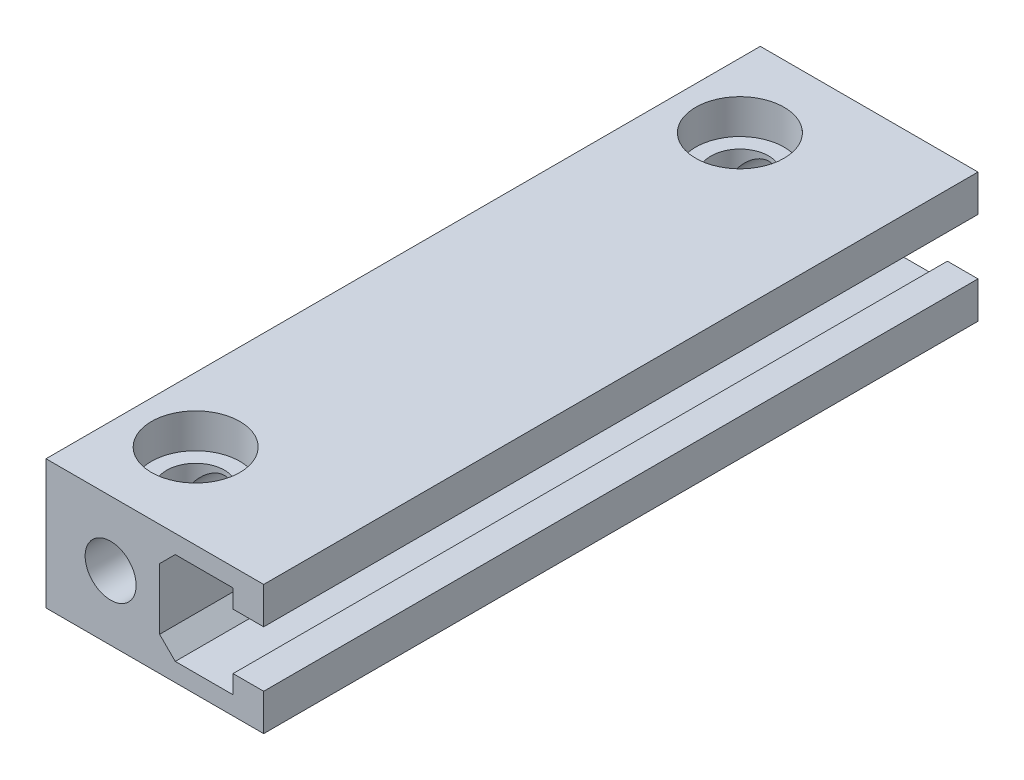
ISO-10303-21;
HEADER;
FILE_DESCRIPTION(('STEP AP214'),'2;1');
FILE_NAME('part.step','',(''),(''),'','','');
FILE_SCHEMA(('AUTOMOTIVE_DESIGN { 1 0 10303 214 1 1 1 1 }'));
ENDSEC;
DATA;
#1=APPLICATION_CONTEXT('core data for automotive mechanical design processes');
#2=APPLICATION_PROTOCOL_DEFINITION('international standard','automotive_design',2000,#1);
#3=PRODUCT_CONTEXT('',#1,'mechanical');
#4=PRODUCT('Part','Part','',(#3));
#5=PRODUCT_RELATED_PRODUCT_CATEGORY('part','',(#4));
#6=PRODUCT_DEFINITION_FORMATION('','',#4);
#7=PRODUCT_DEFINITION_CONTEXT('part definition',#1,'design');
#8=PRODUCT_DEFINITION('design','',#6,#7);
#9=PRODUCT_DEFINITION_SHAPE('','',#8);
#10=(LENGTH_UNIT() NAMED_UNIT(*) SI_UNIT(.MILLI.,.METRE.));
#11=(NAMED_UNIT(*) PLANE_ANGLE_UNIT() SI_UNIT($,.RADIAN.));
#12=(NAMED_UNIT(*) SI_UNIT($,.STERADIAN.) SOLID_ANGLE_UNIT());
#13=UNCERTAINTY_MEASURE_WITH_UNIT(LENGTH_MEASURE(1.E-05),#10,'distance_accuracy_value','');
#14=(GEOMETRIC_REPRESENTATION_CONTEXT(3) GLOBAL_UNCERTAINTY_ASSIGNED_CONTEXT((#13)) GLOBAL_UNIT_ASSIGNED_CONTEXT((#10,
#11,#12)) REPRESENTATION_CONTEXT('',''));
#15=CARTESIAN_POINT('',(0.,0.,0.));
#16=DIRECTION('',(0.,0.,1.));
#17=DIRECTION('',(1.,0.,0.));
#18=AXIS2_PLACEMENT_3D('',#15,#16,#17);
#19=CARTESIAN_POINT('',(-1.75384759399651E-08,9.50000001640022,-40.));
#20=DIRECTION('',(1.84615544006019E-09,-1.,0.));
#21=DIRECTION('',(1.,1.84615544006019E-09,0.));
#22=AXIS2_PLACEMENT_3D('',#19,#20,#21);
#23=CYLINDRICAL_SURFACE('',#22,6.5);
#24=CARTESIAN_POINT('',(-8.16000626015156E-09,4.41999999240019,-40.));
#25=DIRECTION('',(1.84615544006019E-09,-1.,0.));
#26=DIRECTION('',(1.,1.84615544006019E-09,0.));
#27=AXIS2_PLACEMENT_3D('',#24,#25,#26);
#28=CIRCLE('',#27,6.5);
#29=CARTESIAN_POINT('',(6.49999999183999,4.42000000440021,-40.));
#30=VERTEX_POINT('',#29);
#31=EDGE_CURVE('E128',#30,#30,#28,.T.);
#32=ORIENTED_EDGE('',*,*,#31,.T.);
#33=EDGE_LOOP('',(#32));
#34=FACE_BOUND('',#33,.T.);
#35=CARTESIAN_POINT('',(-1.75384758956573E-08,9.49999999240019,-40.));
#36=DIRECTION('',(1.84615544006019E-09,-1.,0.));
#37=DIRECTION('',(1.,1.84615544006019E-09,0.));
#38=AXIS2_PLACEMENT_3D('',#35,#36,#37);
#39=CIRCLE('',#38,6.5);
#40=CARTESIAN_POINT('',(6.49999998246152,9.5000000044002,-40.));
#41=VERTEX_POINT('',#40);
#42=EDGE_CURVE('E20',#41,#41,#39,.T.);
#43=ORIENTED_EDGE('',*,*,#42,.F.);
#44=EDGE_LOOP('',(#43));
#45=FACE_BOUND('',#44,.T.);
#46=ADVANCED_FACE('F15',(#34,#45),#23,.F.);
#47=CARTESIAN_POINT('',(-1.75384759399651E-08,9.50000001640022,40.));
#48=DIRECTION('',(1.84615544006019E-09,-1.,0.));
#49=DIRECTION('',(1.,1.84615544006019E-09,0.));
#50=AXIS2_PLACEMENT_3D('',#47,#48,#49);
#51=CYLINDRICAL_SURFACE('',#50,6.5);
#52=CARTESIAN_POINT('',(-8.16000626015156E-09,4.41999999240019,40.));
#53=DIRECTION('',(1.84615544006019E-09,-1.,0.));
#54=DIRECTION('',(1.,1.84615544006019E-09,0.));
#55=AXIS2_PLACEMENT_3D('',#52,#53,#54);
#56=CIRCLE('',#55,6.5);
#57=CARTESIAN_POINT('',(6.49999999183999,4.42000000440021,40.));
#58=VERTEX_POINT('',#57);
#59=EDGE_CURVE('E142',#58,#58,#56,.T.);
#60=ORIENTED_EDGE('',*,*,#59,.T.);
#61=EDGE_LOOP('',(#60));
#62=FACE_BOUND('',#61,.T.);
#63=CARTESIAN_POINT('',(-1.75384758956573E-08,9.49999999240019,40.));
#64=DIRECTION('',(1.84615544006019E-09,-1.,0.));
#65=DIRECTION('',(1.,1.84615544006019E-09,0.));
#66=AXIS2_PLACEMENT_3D('',#63,#64,#65);
#67=CIRCLE('',#66,6.5);
#68=CARTESIAN_POINT('',(6.49999998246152,9.5000000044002,40.));
#69=VERTEX_POINT('',#68);
#70=EDGE_CURVE('E150',#69,#69,#67,.T.);
#71=ORIENTED_EDGE('',*,*,#70,.F.);
#72=EDGE_LOOP('',(#71));
#73=FACE_BOUND('',#72,.T.);
#74=ADVANCED_FACE('F229',(#62,#73),#51,.F.);
#75=CARTESIAN_POINT('',(7.20000000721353,-4.49999998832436,0.));
#76=DIRECTION('',(0.707106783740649,0.707106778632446,0.));
#77=DIRECTION('',(-0.707106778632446,0.707106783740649,0.));
#78=AXIS2_PLACEMENT_3D('',#75,#76,#77);
#79=PLANE('',#78);
#80=DIRECTION('',(-0.707106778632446,0.707106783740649,0.));
#81=VECTOR('',#80,1.);
#82=CARTESIAN_POINT('',(9.49999999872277,-6.79999999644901,-52.5));
#83=LINE('',#82,#81);
#84=CARTESIAN_POINT('',(9.4999999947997,-6.79999999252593,-52.5));
#85=VERTEX_POINT('',#84);
#86=CARTESIAN_POINT('',(7.20000000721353,-4.49999998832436,-52.5));
#87=VERTEX_POINT('',#86);
#88=EDGE_CURVE('E350',#85,#87,#83,.T.);
#89=ORIENTED_EDGE('',*,*,#88,.T.);
#90=DIRECTION('',(0.,0.,1.));
#91=VECTOR('',#90,1.);
#92=CARTESIAN_POINT('',(7.20000000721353,-4.49999998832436,0.));
#93=LINE('',#92,#91);
#94=CARTESIAN_POINT('',(7.20000000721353,-4.49999998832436,52.5));
#95=VERTEX_POINT('',#94);
#96=EDGE_CURVE('E169',#95,#87,#93,.F.);
#97=ORIENTED_EDGE('',*,*,#96,.F.);
#98=DIRECTION('',(-0.707106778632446,0.707106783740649,0.));
#99=VECTOR('',#98,1.);
#100=CARTESIAN_POINT('',(9.49999999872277,-6.79999999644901,52.5));
#101=LINE('',#100,#99);
#102=CARTESIAN_POINT('',(9.4999999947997,-6.79999999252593,52.5));
#103=VERTEX_POINT('',#102);
#104=EDGE_CURVE('E376',#103,#95,#101,.T.);
#105=ORIENTED_EDGE('',*,*,#104,.F.);
#106=DIRECTION('',(0.,0.,1.));
#107=VECTOR('',#106,1.);
#108=CARTESIAN_POINT('',(9.49999999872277,-6.79999999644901,0.));
#109=LINE('',#108,#107);
#110=EDGE_CURVE('E129',#85,#103,#109,.T.);
#111=ORIENTED_EDGE('',*,*,#110,.F.);
#112=EDGE_LOOP('',(#89,#97,#105,#111));
#113=FACE_BOUND('',#112,.T.);
#114=ADVANCED_FACE('F232',(#113),#79,.T.);
#115=CARTESIAN_POINT('',(7.19999999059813,4.50000000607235,0.));
#116=DIRECTION('',(1.,1.846155E-09,0.));
#117=DIRECTION('',(-1.846155E-09,1.,0.));
#118=AXIS2_PLACEMENT_3D('',#115,#116,#117);
#119=PLANE('',#118);
#120=DIRECTION('',(0.,1.,0.));
#121=VECTOR('',#120,1.);
#122=CARTESIAN_POINT('',(7.20000000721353,1.1315996E-08,-52.5));
#123=LINE('',#122,#121);
#124=CARTESIAN_POINT('',(7.19999999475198,4.5000000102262,-52.5));
#125=VERTEX_POINT('',#124);
#126=EDGE_CURVE('E348',#87,#125,#123,.T.);
#127=ORIENTED_EDGE('',*,*,#126,.T.);
#128=DIRECTION('',(0.,0.,1.));
#129=VECTOR('',#128,1.);
#130=CARTESIAN_POINT('',(7.19999999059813,4.50000000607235,0.));
#131=LINE('',#130,#129);
#132=CARTESIAN_POINT('',(7.19999999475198,4.5000000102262,52.5));
#133=VERTEX_POINT('',#132);
#134=EDGE_CURVE('E166',#133,#125,#131,.F.);
#135=ORIENTED_EDGE('',*,*,#134,.F.);
#136=DIRECTION('',(0.,1.,0.));
#137=VECTOR('',#136,1.);
#138=CARTESIAN_POINT('',(7.20000000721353,1.1315997E-08,52.5));
#139=LINE('',#138,#137);
#140=EDGE_CURVE('E373',#95,#133,#139,.T.);
#141=ORIENTED_EDGE('',*,*,#140,.F.);
#142=ORIENTED_EDGE('',*,*,#96,.T.);
#143=EDGE_LOOP('',(#127,#135,#141,#142));
#144=FACE_BOUND('',#143,.T.);
#145=ADVANCED_FACE('F239',(#144),#119,.T.);
#146=CARTESIAN_POINT('',(9.49999999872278,6.7999999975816,0.));
#147=DIRECTION('',(0.707106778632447,-0.707106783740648,0.));
#148=DIRECTION('',(0.707106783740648,0.707106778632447,0.));
#149=AXIS2_PLACEMENT_3D('',#146,#147,#148);
#150=PLANE('',#149);
#151=DIRECTION('',(0.707106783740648,0.707106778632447,0.));
#152=VECTOR('',#151,1.);
#153=CARTESIAN_POINT('',(7.19999999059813,4.50000000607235,-52.5));
#154=LINE('',#153,#152);
#155=CARTESIAN_POINT('',(9.49999999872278,6.7999999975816,-52.5));
#156=VERTEX_POINT('',#155);
#157=EDGE_CURVE('E346',#125,#156,#154,.T.);
#158=ORIENTED_EDGE('',*,*,#157,.T.);
#159=DIRECTION('',(0.,0.,1.));
#160=VECTOR('',#159,1.);
#161=CARTESIAN_POINT('',(9.49999999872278,6.7999999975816,0.));
#162=LINE('',#161,#160);
#163=CARTESIAN_POINT('',(9.49999999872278,6.7999999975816,52.5));
#164=VERTEX_POINT('',#163);
#165=EDGE_CURVE('E163',#164,#156,#162,.F.);
#166=ORIENTED_EDGE('',*,*,#165,.F.);
#167=DIRECTION('',(0.707106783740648,0.707106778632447,0.));
#168=VECTOR('',#167,1.);
#169=CARTESIAN_POINT('',(7.19999999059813,4.50000000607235,52.5));
#170=LINE('',#169,#168);
#171=EDGE_CURVE('E370',#133,#164,#170,.T.);
#172=ORIENTED_EDGE('',*,*,#171,.F.);
#173=ORIENTED_EDGE('',*,*,#134,.T.);
#174=EDGE_LOOP('',(#158,#166,#172,#173));
#175=FACE_BOUND('',#174,.T.);
#176=ADVANCED_FACE('F243',(#175),#150,.T.);
#177=CARTESIAN_POINT('',(18.0000000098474,6.80000003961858,0.));
#178=DIRECTION('',(4.945527E-09,-1.,0.));
#179=DIRECTION('',(1.,4.945527E-09,0.));
#180=AXIS2_PLACEMENT_3D('',#177,#178,#179);
#181=PLANE('',#180);
#182=DIRECTION('',(1.,0.,0.));
#183=VECTOR('',#182,1.);
#184=CARTESIAN_POINT('',(7.89465140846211,6.7999999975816,-52.5));
#185=LINE('',#184,#183);
#186=CARTESIAN_POINT('',(18.0000000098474,6.80000002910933,-52.5));
#187=VERTEX_POINT('',#186);
#188=EDGE_CURVE('E344',#156,#187,#185,.T.);
#189=ORIENTED_EDGE('',*,*,#188,.T.);
#190=DIRECTION('',(0.,0.,1.));
#191=VECTOR('',#190,1.);
#192=CARTESIAN_POINT('',(18.0000000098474,6.80000003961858,0.));
#193=LINE('',#192,#191);
#194=CARTESIAN_POINT('',(18.0000000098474,6.80000002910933,52.5));
#195=VERTEX_POINT('',#194);
#196=EDGE_CURVE('E160',#195,#187,#193,.F.);
#197=ORIENTED_EDGE('',*,*,#196,.F.);
#198=DIRECTION('',(1.,0.,0.));
#199=VECTOR('',#198,1.);
#200=CARTESIAN_POINT('',(7.89465140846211,6.7999999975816,52.5));
#201=LINE('',#200,#199);
#202=EDGE_CURVE('E367',#164,#195,#201,.T.);
#203=ORIENTED_EDGE('',*,*,#202,.F.);
#204=ORIENTED_EDGE('',*,*,#165,.T.);
#205=EDGE_LOOP('',(#189,#197,#203,#204));
#206=FACE_BOUND('',#205,.T.);
#207=ADVANCED_FACE('F247',(#206),#181,.T.);
#208=CARTESIAN_POINT('',(18.0000000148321,4.10000002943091,0.));
#209=DIRECTION('',(-1.,-1.846156E-09,0.));
#210=DIRECTION('',(1.846156E-09,-1.,0.));
#211=AXIS2_PLACEMENT_3D('',#208,#209,#210);
#212=PLANE('',#211);
#213=DIRECTION('',(0.,1.,0.));
#214=VECTOR('',#213,1.);
#215=CARTESIAN_POINT('',(18.0000000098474,1.1315996E-08,-52.5));
#216=LINE('',#215,#214);
#217=CARTESIAN_POINT('',(18.0000000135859,4.10000002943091,-52.5));
#218=VERTEX_POINT('',#217);
#219=EDGE_CURVE('E342',#187,#218,#216,.F.);
#220=ORIENTED_EDGE('',*,*,#219,.T.);
#221=DIRECTION('',(0.,0.,1.));
#222=VECTOR('',#221,1.);
#223=CARTESIAN_POINT('',(18.0000000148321,4.10000002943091,0.));
#224=LINE('',#223,#222);
#225=CARTESIAN_POINT('',(18.0000000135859,4.10000002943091,52.5));
#226=VERTEX_POINT('',#225);
#227=EDGE_CURVE('E157',#226,#218,#224,.F.);
#228=ORIENTED_EDGE('',*,*,#227,.F.);
#229=DIRECTION('',(0.,1.,0.));
#230=VECTOR('',#229,1.);
#231=CARTESIAN_POINT('',(18.0000000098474,1.1315997E-08,52.5));
#232=LINE('',#231,#230);
#233=EDGE_CURVE('E364',#195,#226,#232,.F.);
#234=ORIENTED_EDGE('',*,*,#233,.F.);
#235=ORIENTED_EDGE('',*,*,#196,.T.);
#236=EDGE_LOOP('',(#220,#228,#234,#235));
#237=FACE_BOUND('',#236,.T.);
#238=ADVANCED_FACE('F251',(#237),#212,.T.);
#239=CARTESIAN_POINT('',(22.5000000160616,4.10000003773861,0.));
#240=DIRECTION('',(1.846156E-09,-1.,0.));
#241=DIRECTION('',(1.,1.846156E-09,0.));
#242=AXIS2_PLACEMENT_3D('',#239,#240,#241);
#243=PLANE('',#242);
#244=DIRECTION('',(1.,0.,0.));
#245=VECTOR('',#244,1.);
#246=CARTESIAN_POINT('',(7.89465140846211,4.10000002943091,-52.5));
#247=LINE('',#246,#245);
#248=CARTESIAN_POINT('',(22.5000000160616,4.10000003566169,-52.5));
#249=VERTEX_POINT('',#248);
#250=EDGE_CURVE('E340',#218,#249,#247,.T.);
#251=ORIENTED_EDGE('',*,*,#250,.T.);
#252=DIRECTION('',(0.,0.,1.));
#253=VECTOR('',#252,1.);
#254=CARTESIAN_POINT('',(22.5000000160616,4.10000003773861,0.));
#255=LINE('',#254,#253);
#256=CARTESIAN_POINT('',(22.5000000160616,4.10000003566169,52.5));
#257=VERTEX_POINT('',#256);
#258=EDGE_CURVE('E154',#257,#249,#255,.F.);
#259=ORIENTED_EDGE('',*,*,#258,.F.);
#260=DIRECTION('',(1.,0.,0.));
#261=VECTOR('',#260,1.);
#262=CARTESIAN_POINT('',(7.89465140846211,4.10000002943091,52.5));
#263=LINE('',#262,#261);
#264=EDGE_CURVE('E361',#226,#257,#263,.T.);
#265=ORIENTED_EDGE('',*,*,#264,.F.);
#266=ORIENTED_EDGE('',*,*,#227,.T.);
#267=EDGE_LOOP('',(#251,#259,#265,#266));
#268=FACE_BOUND('',#267,.T.);
#269=ADVANCED_FACE('F255',(#268),#243,.T.);
#270=CARTESIAN_POINT('',(22.5000000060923,9.50000003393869,0.));
#271=DIRECTION('',(1.,1.846155E-09,0.));
#272=DIRECTION('',(-1.846155E-09,1.,0.));
#273=AXIS2_PLACEMENT_3D('',#270,#271,#272);
#274=PLANE('',#273);
#275=DIRECTION('',(0.,1.,0.));
#276=VECTOR('',#275,1.);
#277=CARTESIAN_POINT('',(22.5000000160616,1.1315996E-08,-52.5));
#278=LINE('',#277,#276);
#279=CARTESIAN_POINT('',(22.5000000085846,9.50000003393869,-52.5));
#280=VERTEX_POINT('',#279);
#281=EDGE_CURVE('E338',#249,#280,#278,.T.);
#282=ORIENTED_EDGE('',*,*,#281,.T.);
#283=DIRECTION('',(0.,0.,1.));
#284=VECTOR('',#283,1.);
#285=CARTESIAN_POINT('',(22.5000000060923,9.50000003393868,0.));
#286=LINE('',#285,#284);
#287=CARTESIAN_POINT('',(22.5000000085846,9.50000003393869,52.5));
#288=VERTEX_POINT('',#287);
#289=EDGE_CURVE('E151',#288,#280,#286,.F.);
#290=ORIENTED_EDGE('',*,*,#289,.F.);
#291=DIRECTION('',(0.,1.,0.));
#292=VECTOR('',#291,1.);
#293=CARTESIAN_POINT('',(22.5000000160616,1.1315997E-08,52.5));
#294=LINE('',#293,#292);
#295=EDGE_CURVE('E358',#257,#288,#294,.T.);
#296=ORIENTED_EDGE('',*,*,#295,.F.);
#297=ORIENTED_EDGE('',*,*,#258,.T.);
#298=EDGE_LOOP('',(#282,#290,#296,#297));
#299=FACE_BOUND('',#298,.T.);
#300=ADVANCED_FACE('F259',(#299),#274,.T.);
#301=CARTESIAN_POINT('',(-9.49999999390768,9.49999997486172,0.));
#302=DIRECTION('',(-1.846155E-09,1.,0.));
#303=DIRECTION('',(-1.,-1.846155E-09,0.));
#304=AXIS2_PLACEMENT_3D('',#301,#302,#303);
#305=PLANE('',#304);
#306=ORIENTED_EDGE('',*,*,#70,.T.);
#307=EDGE_LOOP('',(#306));
#308=FACE_BOUND('',#307,.T.);
#309=ORIENTED_EDGE('',*,*,#42,.T.);
#310=EDGE_LOOP('',(#309));
#311=FACE_BOUND('',#310,.T.);
#312=DIRECTION('',(1.,0.,0.));
#313=VECTOR('',#312,1.);
#314=CARTESIAN_POINT('',(7.89465140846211,9.50000003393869,-52.5));
#315=LINE('',#314,#313);
#316=CARTESIAN_POINT('',(-9.49999999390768,9.49999998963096,-52.5));
#317=VERTEX_POINT('',#316);
#318=EDGE_CURVE('E317',#280,#317,#315,.F.);
#319=ORIENTED_EDGE('',*,*,#318,.T.);
#320=DIRECTION('',(0.,0.,1.));
#321=VECTOR('',#320,1.);
#322=CARTESIAN_POINT('',(-9.49999999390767,9.49999997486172,0.));
#323=LINE('',#322,#321);
#324=CARTESIAN_POINT('',(-9.49999999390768,9.50000000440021,52.5));
#325=VERTEX_POINT('',#324);
#326=EDGE_CURVE('E315',#325,#317,#323,.F.);
#327=ORIENTED_EDGE('',*,*,#326,.F.);
#328=DIRECTION('',(1.,0.,0.));
#329=VECTOR('',#328,1.);
#330=CARTESIAN_POINT('',(7.89465140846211,9.50000003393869,52.5));
#331=LINE('',#330,#329);
#332=EDGE_CURVE('E356',#288,#325,#331,.F.);
#333=ORIENTED_EDGE('',*,*,#332,.F.);
#334=ORIENTED_EDGE('',*,*,#289,.T.);
#335=EDGE_LOOP('',(#319,#327,#333,#334));
#336=FACE_BOUND('',#335,.T.);
#337=ADVANCED_FACE('F263',(#308,#311,#336),#305,.T.);
#338=CARTESIAN_POINT('',(18.0000000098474,-6.79999998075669,0.));
#339=DIRECTION('',(-1.,-1.846154E-09,0.));
#340=DIRECTION('',(1.846154E-09,-1.,0.));
#341=AXIS2_PLACEMENT_3D('',#338,#339,#340);
#342=PLANE('',#341);
#343=DIRECTION('',(0.,1.,0.));
#344=VECTOR('',#343,1.);
#345=CARTESIAN_POINT('',(18.0000000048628,1.1315996E-08,-52.5));
#346=LINE('',#345,#344);
#347=CARTESIAN_POINT('',(18.0000000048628,-4.0999999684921,-52.5));
#348=VERTEX_POINT('',#347);
#349=CARTESIAN_POINT('',(18.0000000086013,-6.79999998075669,-52.5));
#350=VERTEX_POINT('',#349);
#351=EDGE_CURVE('E334',#348,#350,#346,.F.);
#352=ORIENTED_EDGE('',*,*,#351,.T.);
#353=DIRECTION('',(0.,0.,1.));
#354=VECTOR('',#353,1.);
#355=CARTESIAN_POINT('',(18.0000000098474,-6.79999998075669,0.));
#356=LINE('',#355,#354);
#357=CARTESIAN_POINT('',(18.0000000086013,-6.79999998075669,52.5));
#358=VERTEX_POINT('',#357);
#359=EDGE_CURVE('E115',#358,#350,#356,.F.);
#360=ORIENTED_EDGE('',*,*,#359,.F.);
#361=DIRECTION('',(0.,1.,0.));
#362=VECTOR('',#361,1.);
#363=CARTESIAN_POINT('',(18.0000000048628,1.1315997E-08,52.5));
#364=LINE('',#363,#362);
#365=CARTESIAN_POINT('',(18.0000000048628,-4.0999999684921,52.5));
#366=VERTEX_POINT('',#365);
#367=EDGE_CURVE('E132',#366,#358,#364,.F.);
#368=ORIENTED_EDGE('',*,*,#367,.F.);
#369=DIRECTION('',(0.,0.,1.));
#370=VECTOR('',#369,1.);
#371=CARTESIAN_POINT('',(18.0000000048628,-4.09999997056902,0.));
#372=LINE('',#371,#370);
#373=EDGE_CURVE('E120',#348,#366,#372,.T.);
#374=ORIENTED_EDGE('',*,*,#373,.F.);
#375=EDGE_LOOP('',(#352,#360,#368,#374));
#376=FACE_BOUND('',#375,.T.);
#377=ADVANCED_FACE('F133',(#376),#342,.T.);
#378=CARTESIAN_POINT('',(9.49999999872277,-6.79999999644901,0.));
#379=DIRECTION('',(-1.846155E-09,1.,0.));
#380=DIRECTION('',(-1.,-1.846155E-09,0.));
#381=AXIS2_PLACEMENT_3D('',#378,#379,#380);
#382=PLANE('',#381);
#383=DIRECTION('',(1.,0.,0.));
#384=VECTOR('',#383,1.);
#385=CARTESIAN_POINT('',(7.89465140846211,-6.79999998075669,-52.5));
#386=LINE('',#385,#384);
#387=EDGE_CURVE('E331',#350,#85,#386,.F.);
#388=ORIENTED_EDGE('',*,*,#387,.T.);
#389=ORIENTED_EDGE('',*,*,#110,.T.);
#390=DIRECTION('',(1.,0.,0.));
#391=VECTOR('',#390,1.);
#392=CARTESIAN_POINT('',(7.89465140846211,-6.79999998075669,52.5));
#393=LINE('',#392,#391);
#394=EDGE_CURVE('E136',#358,#103,#393,.F.);
#395=ORIENTED_EDGE('',*,*,#394,.F.);
#396=ORIENTED_EDGE('',*,*,#359,.T.);
#397=EDGE_LOOP('',(#388,#389,#395,#396));
#398=FACE_BOUND('',#397,.T.);
#399=ADVANCED_FACE('F270',(#398),#382,.T.);
#400=CARTESIAN_POINT('',(18.0000000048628,-4.09999997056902,0.));
#401=DIRECTION('',(-1.846156E-09,1.,0.));
#402=DIRECTION('',(-1.,-1.846156E-09,0.));
#403=AXIS2_PLACEMENT_3D('',#400,#401,#402);
#404=PLANE('',#403);
#405=DIRECTION('',(1.,0.,0.));
#406=VECTOR('',#405,1.);
#407=CARTESIAN_POINT('',(7.89465140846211,-4.09999996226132,-52.5));
#408=LINE('',#407,#406);
#409=CARTESIAN_POINT('',(22.5000000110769,-4.09999996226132,-52.5));
#410=VERTEX_POINT('',#409);
#411=EDGE_CURVE('E126',#410,#348,#408,.F.);
#412=ORIENTED_EDGE('',*,*,#411,.T.);
#413=ORIENTED_EDGE('',*,*,#373,.T.);
#414=DIRECTION('',(1.,0.,0.));
#415=VECTOR('',#414,1.);
#416=CARTESIAN_POINT('',(7.89465140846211,-4.09999996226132,52.5));
#417=LINE('',#416,#415);
#418=CARTESIAN_POINT('',(22.5000000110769,-4.09999996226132,52.5));
#419=VERTEX_POINT('',#418);
#420=EDGE_CURVE('E124',#419,#366,#417,.F.);
#421=ORIENTED_EDGE('',*,*,#420,.F.);
#422=DIRECTION('',(0.,0.,1.));
#423=VECTOR('',#422,1.);
#424=CARTESIAN_POINT('',(22.5000000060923,-4.09999996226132,0.));
#425=LINE('',#424,#423);
#426=EDGE_CURVE('E209',#410,#419,#425,.T.);
#427=ORIENTED_EDGE('',*,*,#426,.F.);
#428=EDGE_LOOP('',(#412,#413,#421,#427));
#429=FACE_BOUND('',#428,.T.);
#430=ADVANCED_FACE('F121',(#429),#404,.T.);
#431=CARTESIAN_POINT('',(0.,0.,0.));
#432=DIRECTION('',(0.,0.,1.));
#433=DIRECTION('',(1.,0.,0.));
#434=AXIS2_PLACEMENT_3D('',#431,#432,#433);
#435=CYLINDRICAL_SURFACE('',#434,3.75);
#436=CARTESIAN_POINT('',(3.75,3.46154166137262E-09,-42.));
#437=CARTESIAN_POINT('',(3.75000015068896,0.0591698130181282,-41.9999996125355));
#438=CARTESIAN_POINT('',(3.74859482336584,0.118337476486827,-42.0026421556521));
#439=CARTESIAN_POINT('',(3.74302523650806,0.236104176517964,-42.013030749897));
#440=CARTESIAN_POINT('',(3.73885970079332,0.294702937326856,-42.0207791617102));
#441=CARTESIAN_POINT('',(3.72236852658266,0.469145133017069,-42.0511036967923));
#442=CARTESIAN_POINT('',(3.70604902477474,0.583407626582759,-42.0807564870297));
#443=CARTESIAN_POINT('',(3.65472003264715,0.855971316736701,-42.1700510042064));
#444=CARTESIAN_POINT('',(3.61458785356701,1.01069707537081,-42.2371966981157));
#445=CARTESIAN_POINT('',(3.51808248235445,1.30771067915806,-42.3861153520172));
#446=CARTESIAN_POINT('',(3.46164565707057,1.44994688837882,-42.4679451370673));
#447=CARTESIAN_POINT('',(3.34596758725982,1.69762921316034,-42.6219253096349));
#448=CARTESIAN_POINT('',(3.28925760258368,1.80495817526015,-42.6929950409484));
#449=CARTESIAN_POINT('',(3.16622342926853,2.01299476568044,-42.8366310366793));
#450=CARTESIAN_POINT('',(3.09989379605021,2.11369859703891,-42.9091981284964));
#451=CARTESIAN_POINT('',(2.95770972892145,2.30845467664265,-43.0536400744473));
#452=CARTESIAN_POINT('',(2.88186605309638,2.40251425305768,-43.1255156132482));
#453=CARTESIAN_POINT('',(2.72053727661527,2.58377464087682,-43.2669077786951));
#454=CARTESIAN_POINT('',(2.63505665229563,2.67097860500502,-43.3364254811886));
#455=CARTESIAN_POINT('',(2.40622885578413,2.88237278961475,-43.5074779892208));
#456=CARTESIAN_POINT('',(2.25624471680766,3.00163493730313,-43.6064278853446));
#457=CARTESIAN_POINT('',(1.93357443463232,3.21892900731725,-43.7892070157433));
#458=CARTESIAN_POINT('',(1.76092761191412,3.31699693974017,-43.8730618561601));
#459=CARTESIAN_POINT('',(1.42941062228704,3.47073032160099,-44.0055910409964));
#460=CARTESIAN_POINT('',(1.27414303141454,3.53091075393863,-44.0579217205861));
#461=CARTESIAN_POINT('',(1.03305447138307,3.60588562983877,-44.1233804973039));
#462=CARTESIAN_POINT('',(0.951303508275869,3.62833202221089,-44.1430308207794));
#463=CARTESIAN_POINT('',(0.785539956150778,3.66778850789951,-44.1776286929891));
#464=CARTESIAN_POINT('',(0.701528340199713,3.68480090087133,-44.1925782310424));
#465=CARTESIAN_POINT('',(0.531302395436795,3.7131804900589,-44.2175423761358));
#466=CARTESIAN_POINT('',(0.445077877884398,3.72451321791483,-44.2275268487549));
#467=CARTESIAN_POINT('',(0.271637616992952,3.74116283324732,-44.2422027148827));
#468=CARTESIAN_POINT('',(0.18442231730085,3.74648231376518,-44.2468963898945));
#469=CARTESIAN_POINT('',(0.00970159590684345,3.7510049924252,-44.2508866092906));
#470=CARTESIAN_POINT('',(-0.0778038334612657,3.75020802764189,-44.2501830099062));
#471=CARTESIAN_POINT('',(-0.252310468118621,3.7425234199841,-44.2434042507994));
#472=CARTESIAN_POINT('',(-0.339311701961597,3.73563612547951,-44.2373293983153));
#473=CARTESIAN_POINT('',(-0.583131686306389,3.70775897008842,-44.2127657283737));
#474=CARTESIAN_POINT('',(-0.738629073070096,3.67983325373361,-44.1881797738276));
#475=CARTESIAN_POINT('',(-1.04166886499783,3.60580599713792,-44.1232905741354));
#476=CARTESIAN_POINT('',(-1.18920915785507,3.55969965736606,-44.0829831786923));
#477=CARTESIAN_POINT('',(-1.4830174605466,3.44810318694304,-43.9860500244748));
#478=CARTESIAN_POINT('',(-1.628585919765,3.38155218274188,-43.9285374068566));
#479=CARTESIAN_POINT('',(-1.90603053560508,3.2333164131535,-43.8016945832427));
#480=CARTESIAN_POINT('',(-2.03790455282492,3.15162928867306,-43.7323625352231));
#481=CARTESIAN_POINT('',(-2.35229128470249,2.92969332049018,-43.5464956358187));
#482=CARTESIAN_POINT('',(-2.5255406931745,2.78106129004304,-43.4241445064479));
#483=CARTESIAN_POINT('',(-2.76083962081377,2.54026931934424,-43.2327420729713));
#484=CARTESIAN_POINT('',(-2.83535915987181,2.45675943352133,-43.1674250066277));
#485=CARTESIAN_POINT('',(-2.976210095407,2.28409099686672,-43.0354503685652));
#486=CARTESIAN_POINT('',(-3.0425447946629,2.19493474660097,-42.9687933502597));
#487=CARTESIAN_POINT('',(-3.16855433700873,2.00890337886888,-42.8339863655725));
#488=CARTESIAN_POINT('',(-3.22803486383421,1.91189568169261,-42.7658383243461));
#489=CARTESIAN_POINT('',(-3.33849556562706,1.71173207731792,-42.6314460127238));
#490=CARTESIAN_POINT('',(-3.38946866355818,1.60857114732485,-42.5652033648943));
#491=CARTESIAN_POINT('',(-3.48230443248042,1.39621418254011,-42.4376693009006));
#492=CARTESIAN_POINT('',(-3.52421938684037,1.2870576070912,-42.3763508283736));
#493=CARTESIAN_POINT('',(-3.59858591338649,1.06148337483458,-42.2621451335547));
#494=CARTESIAN_POINT('',(-3.63105689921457,0.945081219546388,-42.2092407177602));
#495=CARTESIAN_POINT('',(-3.68129818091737,0.722193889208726,-42.1242935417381));
#496=CARTESIAN_POINT('',(-3.70053539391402,0.616802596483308,-42.0903195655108));
#497=CARTESIAN_POINT('',(-3.73004143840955,0.401297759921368,-42.0372133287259));
#498=CARTESIAN_POINT('',(-3.74033984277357,0.291201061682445,-42.0180321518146));
#499=CARTESIAN_POINT('',(-3.7510648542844,0.0677640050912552,-41.9980425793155));
#500=CARTESIAN_POINT('',(-3.75140304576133,-0.0455964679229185,-41.9973987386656));
#501=CARTESIAN_POINT('',(-3.74193333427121,-0.270489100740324,-42.0150705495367));
#502=CARTESIAN_POINT('',(-3.73210637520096,-0.382017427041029,-42.0334218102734));
#503=CARTESIAN_POINT('',(-3.69935585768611,-0.630062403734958,-42.0925221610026));
#504=CARTESIAN_POINT('',(-3.67357161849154,-0.765005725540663,-42.138046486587));
#505=CARTESIAN_POINT('',(-3.60952782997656,-1.02565428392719,-42.24447130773));
#506=CARTESIAN_POINT('',(-3.57122251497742,-1.15132352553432,-42.3054280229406));
#507=CARTESIAN_POINT('',(-3.48843329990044,-1.38076369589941,-42.4286321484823));
#508=CARTESIAN_POINT('',(-3.44508082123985,-1.48542738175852,-42.4900117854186));
#509=CARTESIAN_POINT('',(-3.35011888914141,-1.6887277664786,-42.616382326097));
#510=CARTESIAN_POINT('',(-3.29850358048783,-1.78736012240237,-42.6813757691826));
#511=CARTESIAN_POINT('',(-3.18714234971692,-1.97912323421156,-42.8128390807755));
#512=CARTESIAN_POINT('',(-3.12738476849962,-2.07224582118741,-42.8793109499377));
#513=CARTESIAN_POINT('',(-2.99981835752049,-2.25295727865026,-43.0119861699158));
#514=CARTESIAN_POINT('',(-2.93201164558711,-2.3405475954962,-43.0781895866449));
#515=CARTESIAN_POINT('',(-2.78449823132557,-2.51450628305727,-43.2124018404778));
#516=CARTESIAN_POINT('',(-2.70435528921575,-2.60057257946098,-43.2803247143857));
#517=CARTESIAN_POINT('',(-2.53491775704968,-2.76599223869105,-43.4129568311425));
#518=CARTESIAN_POINT('',(-2.44562103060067,-2.84534402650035,-43.4776653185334));
#519=CARTESIAN_POINT('',(-2.25809887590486,-2.99631834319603,-43.6022371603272));
#520=CARTESIAN_POINT('',(-2.15990048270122,-3.06796292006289,-43.6621142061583));
#521=CARTESIAN_POINT('',(-1.95458179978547,-3.20268581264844,-43.7756969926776));
#522=CARTESIAN_POINT('',(-1.84746712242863,-3.26576945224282,-43.8294065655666));
#523=CARTESIAN_POINT('',(-1.59001042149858,-3.40020536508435,-43.9445969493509));
#524=CARTESIAN_POINT('',(-1.43654084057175,-3.46808631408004,-44.0033483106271));
#525=CARTESIAN_POINT('',(-1.19705534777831,-3.55482744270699,-44.0787988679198));
#526=CARTESIAN_POINT('',(-1.11566223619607,-3.58123166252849,-44.1018397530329));
#527=CARTESIAN_POINT('',(-0.950184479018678,-3.62864193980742,-44.1432968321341));
#528=CARTESIAN_POINT('',(-0.866101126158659,-3.64965054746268,-44.1617152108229));
#529=CARTESIAN_POINT('',(-0.695158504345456,-3.68604770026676,-44.1936704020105));
#530=CARTESIAN_POINT('',(-0.608283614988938,-3.70139471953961,-44.2071711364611));
#531=CARTESIAN_POINT('',(-0.43304596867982,-3.72596232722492,-44.2288014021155));
#532=CARTESIAN_POINT('',(-0.344683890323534,-3.73518563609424,-44.2369333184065));
#533=CARTESIAN_POINT('',(-0.16719238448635,-3.74732615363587,-44.2476398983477));
#534=CARTESIAN_POINT('',(-0.0780630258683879,-3.75024392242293,-44.2502150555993));
#535=CARTESIAN_POINT('',(0.100133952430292,-3.74972360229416,-44.249756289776));
#536=CARTESIAN_POINT('',(0.189201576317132,-3.74628600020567,-44.2467227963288));
#537=CARTESIAN_POINT('',(0.437321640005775,-3.72783108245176,-44.230447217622));
#538=CARTESIAN_POINT('',(0.595532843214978,-3.70576472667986,-44.2109926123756));
#539=CARTESIAN_POINT('',(0.904951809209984,-3.64260555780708,-44.1555207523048));
#540=CARTESIAN_POINT('',(1.05615825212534,-3.6015091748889,-44.1195003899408));
#541=CARTESIAN_POINT('',(1.35414073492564,-3.50063785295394,-44.0316032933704));
#542=CARTESIAN_POINT('',(1.50053335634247,-3.44021568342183,-43.9791787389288));
#543=CARTESIAN_POINT('',(1.78054883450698,-3.30400404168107,-43.8620265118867));
#544=CARTESIAN_POINT('',(1.914167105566,-3.22820908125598,-43.7972944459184));
#545=CARTESIAN_POINT('',(2.23133665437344,-3.02243225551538,-43.6236199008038));
#546=CARTESIAN_POINT('',(2.40644254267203,-2.88430756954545,-43.5087570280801));
#547=CARTESIAN_POINT('',(2.64580581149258,-2.65975014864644,-43.3275124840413));
#548=CARTESIAN_POINT('',(2.72185209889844,-2.58181230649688,-43.2654598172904));
#549=CARTESIAN_POINT('',(2.86624011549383,-2.42050969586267,-43.1394777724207));
#550=CARTESIAN_POINT('',(2.93458470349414,-2.33714695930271,-43.0755491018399));
#551=CARTESIAN_POINT('',(3.06506785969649,-2.16331693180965,-42.9455947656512));
#552=CARTESIAN_POINT('',(3.12703549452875,-2.07273319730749,-42.8795540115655));
#553=CARTESIAN_POINT('',(3.24306625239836,-1.88602970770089,-42.7482167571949));
#554=CARTESIAN_POINT('',(3.29712550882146,-1.78990727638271,-42.6829206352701));
#555=CARTESIAN_POINT('',(3.39705608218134,-1.59209403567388,-42.5552024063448));
#556=CARTESIAN_POINT('',(3.4429494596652,-1.490419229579,-42.4927729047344));
#557=CARTESIAN_POINT('',(3.52632627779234,-1.28071694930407,-42.3733544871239));
#558=CARTESIAN_POINT('',(3.56381963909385,-1.1726971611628,-42.3163591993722));
#559=CARTESIAN_POINT('',(3.62883479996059,-0.952327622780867,-42.2130695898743));
#560=CARTESIAN_POINT('',(3.65658899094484,-0.840161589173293,-42.1665370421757));
#561=CARTESIAN_POINT('',(3.70205491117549,-0.60910061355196,-42.0879146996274));
#562=CARTESIAN_POINT('',(3.7198078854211,-0.490235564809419,-42.0557657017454));
#563=CARTESIAN_POINT('',(3.73780131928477,-0.308344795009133,-42.0227434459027));
#564=CARTESIAN_POINT('',(3.74235988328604,-0.247091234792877,-42.0142692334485));
#565=CARTESIAN_POINT('',(3.74845930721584,-0.123891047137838,-42.0028974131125));
#566=CARTESIAN_POINT('',(3.74999984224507,-0.0619443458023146,-42.0000004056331));
#567=CARTESIAN_POINT('',(3.75,3.46154166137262E-09,-42.));
#568=B_SPLINE_CURVE_WITH_KNOTS('',3,(#436,#437,#438,#439,#440,#441,#442,#443,#444,#445,#446,
#447,#448,#449,#450,#451,#452,#453,#454,#455,#456,#457,#458,#459,#460,#461,#462,#463,#464,#465,
#466,#467,#468,#469,#470,#471,#472,#473,#474,#475,#476,#477,#478,#479,#480,#481,#482,#483,#484,
#485,#486,#487,#488,#489,#490,#491,#492,#493,#494,#495,#496,#497,#498,#499,#500,#501,#502,#503,
#504,#505,#506,#507,#508,#509,#510,#511,#512,#513,#514,#515,#516,#517,#518,#519,#520,#521,#522,
#523,#524,#525,#526,#527,#528,#529,#530,#531,#532,#533,#534,#535,#536,#537,#538,#539,#540,#541,
#542,#543,#544,#545,#546,#547,#548,#549,#550,#551,#552,#553,#554,#555,#556,#557,#558,#559,#560,
#561,#562,#563,#564,#565,#566,#567),.UNSPECIFIED.,.T.,.F.,(4,2,2,2,2,2,2,2,2,2,2,2,2,2,2,2,2,2,
2,2,2,2,2,2,2,2,2,2,2,2,2,2,2,2,2,2,2,2,2,2,2,2,2,2,2,2,2,2,2,2,2,2,2,2,2,2,2,2,2,2,2,2,2,2,2,
4),(0.,0.177429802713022,0.35494169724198,0.710634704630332,1.22791760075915,1.74724725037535,
2.16874151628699,2.59047527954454,3.01173639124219,3.43280262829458,4.07730096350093,
4.72069549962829,5.24199924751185,5.50279443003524,5.76347909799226,6.02572719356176,
6.28786215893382,6.55000410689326,6.81213106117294,7.28946118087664,7.76691739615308,
8.27525604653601,8.78367399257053,9.5560968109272,9.9445981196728,10.3329421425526,
10.7304589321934,11.1283047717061,11.5237889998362,11.9184544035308,12.2545180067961,
12.5894655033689,12.9273854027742,13.2659399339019,13.6976973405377,14.1310508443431,
14.5170838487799,14.9033916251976,15.2902584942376,15.6770237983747,16.0839640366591,
16.4909994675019,16.8968376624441,17.3024223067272,17.8333727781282,18.0989576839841,
18.3644168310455,18.6317860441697,18.8990363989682,19.1662630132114,19.4334691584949,
19.9137965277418,20.3942140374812,20.8927882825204,21.3915408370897,22.139713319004,
22.5154526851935,22.8910521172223,23.2749685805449,23.6590721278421,24.0421217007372,
24.4247164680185,24.7974363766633,25.168607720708,25.3543374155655,25.5400871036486),.UNSPECIFIED.);
#569=CARTESIAN_POINT('',(3.75,3.46154166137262E-09,-42.));
#570=VERTEX_POINT('',#569);
#571=EDGE_CURVE('E208',#570,#570,#568,.T.);
#572=ORIENTED_EDGE('',*,*,#571,.T.);
#573=EDGE_LOOP('',(#572));
#574=FACE_BOUND('',#573,.T.);
#575=CARTESIAN_POINT('',(0.,0.,-52.5));
#576=DIRECTION('',(0.,0.,1.));
#577=DIRECTION('',(1.,0.,0.));
#578=AXIS2_PLACEMENT_3D('',#575,#576,#577);
#579=CIRCLE('',#578,3.75);
#580=CARTESIAN_POINT('',(3.75,0.,-52.5));
#581=VERTEX_POINT('',#580);
#582=EDGE_CURVE('E212',#581,#581,#579,.F.);
#583=ORIENTED_EDGE('',*,*,#582,.T.);
#584=EDGE_LOOP('',(#583));
#585=FACE_BOUND('',#584,.T.);
#586=ADVANCED_FACE('F227',(#574,#585),#435,.F.);
#587=CARTESIAN_POINT('',(-6.63000000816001,4.41999998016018,-46.63));
#588=DIRECTION('',(1.84615545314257E-09,-1.,0.));
#589=DIRECTION('',(1.,1.84615545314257E-09,0.));
#590=AXIS2_PLACEMENT_3D('',#587,#588,#589);
#591=PLANE('',#590);
#592=CARTESIAN_POINT('',(-8.16000716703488E-09,4.41999999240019,-40.));
#593=DIRECTION('',(1.84615394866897E-09,-1.,0.));
#594=DIRECTION('',(1.,1.84615394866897E-09,0.));
#595=AXIS2_PLACEMENT_3D('',#592,#593,#594);
#596=CIRCLE('',#595,4.24999999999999);
#597=CARTESIAN_POINT('',(4.24999999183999,4.42000000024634,-40.));
#598=VERTEX_POINT('',#597);
#599=EDGE_CURVE('E414',#598,#598,#596,.T.);
#600=ORIENTED_EDGE('',*,*,#599,.T.);
#601=EDGE_LOOP('',(#600));
#602=FACE_BOUND('',#601,.T.);
#603=ORIENTED_EDGE('',*,*,#31,.F.);
#604=EDGE_LOOP('',(#603));
#605=FACE_BOUND('',#604,.T.);
#606=ADVANCED_FACE('F224',(#602,#605),#591,.F.);
#607=CARTESIAN_POINT('',(0.,0.,0.));
#608=DIRECTION('',(0.,0.,1.));
#609=DIRECTION('',(1.,0.,0.));
#610=AXIS2_PLACEMENT_3D('',#607,#608,#609);
#611=CYLINDRICAL_SURFACE('',#610,3.75);
#612=CARTESIAN_POINT('',(0.,0.,52.5));
#613=DIRECTION('',(0.,0.,1.));
#614=DIRECTION('',(1.,0.,0.));
#615=AXIS2_PLACEMENT_3D('',#612,#613,#614);
#616=CIRCLE('',#615,3.75);
#617=CARTESIAN_POINT('',(3.75,0.,52.5));
#618=VERTEX_POINT('',#617);
#619=EDGE_CURVE('E355',#618,#618,#616,.F.);
#620=ORIENTED_EDGE('',*,*,#619,.F.);
#621=EDGE_LOOP('',(#620));
#622=FACE_BOUND('',#621,.T.);
#623=CARTESIAN_POINT('',(3.75,3.46154212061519E-09,42.));
#624=CARTESIAN_POINT('',(3.75000015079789,-0.0591698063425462,41.9999996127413));
#625=CARTESIAN_POINT('',(3.74859482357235,-0.118337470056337,42.0026421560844));
#626=CARTESIAN_POINT('',(3.74302523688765,-0.236104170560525,42.0130307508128));
#627=CARTESIAN_POINT('',(3.73885970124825,-0.294702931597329,42.0207791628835));
#628=CARTESIAN_POINT('',(3.72236852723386,-0.469145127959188,42.051103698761));
#629=CARTESIAN_POINT('',(3.70604902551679,-0.583407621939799,42.0807564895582));
#630=CARTESIAN_POINT('',(3.6547200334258,-0.855971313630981,42.1700510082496));
#631=CARTESIAN_POINT('',(3.61458785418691,-1.01069707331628,42.2371967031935));
#632=CARTESIAN_POINT('',(3.51808248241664,-1.30771067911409,42.3861153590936));
#633=CARTESIAN_POINT('',(3.46164565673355,-1.44994688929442,42.4679451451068));
#634=CARTESIAN_POINT('',(3.34596758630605,-1.69762921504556,42.6219253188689));
#635=CARTESIAN_POINT('',(3.28925760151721,-1.80495817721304,42.6929950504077));
#636=CARTESIAN_POINT('',(3.16622342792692,-2.01299476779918,42.8366310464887));
#637=CARTESIAN_POINT('',(3.09989379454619,-2.11369859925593,42.9091981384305));
#638=CARTESIAN_POINT('',(2.95770972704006,-2.30845467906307,43.0536400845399));
#639=CARTESIAN_POINT('',(2.88186605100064,-2.4025142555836,43.1255156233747));
#640=CARTESIAN_POINT('',(2.72053727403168,-2.58377464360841,43.2669077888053));
#641=CARTESIAN_POINT('',(2.6350566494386,-2.67097860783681,43.3364254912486));
#642=CARTESIAN_POINT('',(2.40622885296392,-2.8823727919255,43.5074779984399));
#643=CARTESIAN_POINT('',(2.25624471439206,-3.0016349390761,43.6064278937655));
#644=CARTESIAN_POINT('',(1.93357443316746,-3.21892900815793,43.7892070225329));
#645=CARTESIAN_POINT('',(1.76092761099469,-3.31699694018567,43.8730618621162));
#646=CARTESIAN_POINT('',(1.42941062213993,-3.47073032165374,44.0055910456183));
#647=CARTESIAN_POINT('',(1.27414303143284,-3.53091075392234,44.0579217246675));
#648=CARTESIAN_POINT('',(1.03305447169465,-3.60588562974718,44.1233805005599));
#649=CARTESIAN_POINT('',(0.951303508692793,-3.62833202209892,44.1430308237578));
#650=CARTESIAN_POINT('',(0.785539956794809,-3.66778850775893,44.1776286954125));
#651=CARTESIAN_POINT('',(0.701528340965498,-3.68480090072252,44.1925782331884));
#652=CARTESIAN_POINT('',(0.531302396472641,-3.71318048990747,44.2175423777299));
#653=CARTESIAN_POINT('',(0.445077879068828,-3.72451321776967,44.227526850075));
#654=CARTESIAN_POINT('',(0.271637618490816,-3.74116283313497,44.2422027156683));
#655=CARTESIAN_POINT('',(0.184422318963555,-3.74648231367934,44.2468963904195));
#656=CARTESIAN_POINT('',(0.00970159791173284,-3.75100499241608,44.2508866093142));
#657=CARTESIAN_POINT('',(-0.077803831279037,-3.75020802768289,44.2501830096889));
#658=CARTESIAN_POINT('',(-0.25231046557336,-3.74252342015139,44.2434042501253));
#659=CARTESIAN_POINT('',(-0.339311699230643,-3.73563612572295,44.2373293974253));
#660=CARTESIAN_POINT('',(-0.583131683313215,-3.70775897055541,44.2127657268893));
#661=CARTESIAN_POINT('',(-0.738629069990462,-3.67983325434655,44.1881797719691));
#662=CARTESIAN_POINT('',(-1.04166886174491,-3.60580599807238,44.1232905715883));
#663=CARTESIAN_POINT('',(-1.18920915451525,-3.55969965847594,44.0829831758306));
#664=CARTESIAN_POINT('',(-1.48301745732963,-3.44810318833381,43.9860500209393));
#665=CARTESIAN_POINT('',(-1.62858591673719,-3.38155218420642,43.9285374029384));
#666=CARTESIAN_POINT('',(-1.90603053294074,-3.23331641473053,43.8016945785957));
#667=CARTESIAN_POINT('',(-2.03790455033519,-3.15162929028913,43.7323625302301));
#668=CARTESIAN_POINT('',(-2.3522912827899,-2.92969332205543,43.5464956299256));
#669=CARTESIAN_POINT('',(-2.52554069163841,-2.7810612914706,43.4241445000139));
#670=CARTESIAN_POINT('',(-2.76083961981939,-2.54026932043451,43.2327420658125));
#671=CARTESIAN_POINT('',(-2.83535915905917,-2.45675943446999,43.1674249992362));
#672=CARTESIAN_POINT('',(-2.97621009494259,-2.28409099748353,43.0354503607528));
#673=CARTESIAN_POINT('',(-3.042544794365,-2.19493474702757,42.9687933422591));
#674=CARTESIAN_POINT('',(-3.16855433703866,-2.00890337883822,42.8339863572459));
#675=CARTESIAN_POINT('',(-3.22803486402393,-1.9118956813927,42.7658383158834));
#676=CARTESIAN_POINT('',(-3.33849556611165,-1.71173207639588,42.6314460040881));
#677=CARTESIAN_POINT('',(-3.38946866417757,-1.60857114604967,42.5652033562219));
#678=CARTESIAN_POINT('',(-3.48230443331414,-1.39621418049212,42.4376692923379));
#679=CARTESIAN_POINT('',(-3.52421938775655,-1.28705760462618,42.3763508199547));
#680=CARTESIAN_POINT('',(-3.59858591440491,-1.06148337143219,42.2621451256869));
#681=CARTESIAN_POINT('',(-3.63105690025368,-0.945081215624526,42.2092407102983));
#682=CARTESIAN_POINT('',(-3.68129818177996,-0.722193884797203,42.1242935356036));
#683=CARTESIAN_POINT('',(-3.7005353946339,-0.616802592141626,42.0903195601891));
#684=CARTESIAN_POINT('',(-3.73004143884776,-0.401297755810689,42.0372133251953));
#685=CARTESIAN_POINT('',(-3.74033984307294,-0.291201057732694,42.0180321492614));
#686=CARTESIAN_POINT('',(-3.75106485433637,-0.0677640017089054,41.998042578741));
#687=CARTESIAN_POINT('',(-3.75140304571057,0.0455964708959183,41.9973987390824));
#688=CARTESIAN_POINT('',(-3.74193333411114,0.270489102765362,42.0150705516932));
#689=CARTESIAN_POINT('',(-3.73210637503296,0.382017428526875,42.0334218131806));
#690=CARTESIAN_POINT('',(-3.69935585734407,0.630062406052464,42.092522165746));
#691=CARTESIAN_POINT('',(-3.67357161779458,0.765005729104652,42.1380464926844));
#692=CARTESIAN_POINT('',(-3.60952782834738,1.02565428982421,42.2444713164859));
#693=CARTESIAN_POINT('',(-3.5712225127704,1.15132353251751,42.3054280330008));
#694=CARTESIAN_POINT('',(-3.48843329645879,1.38076370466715,42.4286321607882));
#695=CARTESIAN_POINT('',(-3.44508081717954,1.48542739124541,42.4900117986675));
#696=CARTESIAN_POINT('',(-3.35011888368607,1.68872777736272,42.6163823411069));
#697=CARTESIAN_POINT('',(-3.2985035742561,1.78736013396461,42.6813757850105));
#698=CARTESIAN_POINT('',(-3.18714234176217,1.97912324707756,42.8128390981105));
#699=CARTESIAN_POINT('',(-3.12738475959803,2.07224583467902,42.8793109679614));
#700=CARTESIAN_POINT('',(-2.99981834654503,2.25295729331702,43.0119861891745));
#701=CARTESIAN_POINT('',(-2.93201163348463,2.34054761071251,43.07818960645));
#702=CARTESIAN_POINT('',(-2.78449821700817,2.51450629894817,43.2124018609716));
#703=CARTESIAN_POINT('',(-2.70435527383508,2.60057259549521,43.2803247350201));
#704=CARTESIAN_POINT('',(-2.53491773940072,2.76599225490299,43.4129568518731));
#705=CARTESIAN_POINT('',(-2.44562101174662,2.84534404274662,43.4776653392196));
#706=CARTESIAN_POINT('',(-2.25809885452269,2.99631835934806,43.6022371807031));
#707=CARTESIAN_POINT('',(-2.15990045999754,3.06796293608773,43.6621142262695));
#708=CARTESIAN_POINT('',(-1.95458177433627,3.20268582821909,43.7756970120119));
#709=CARTESIAN_POINT('',(-1.84746709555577,3.26576946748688,43.829406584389));
#710=CARTESIAN_POINT('',(-1.59001039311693,3.40020537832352,43.9445969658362));
#711=CARTESIAN_POINT('',(-1.43654081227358,3.46808632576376,44.0033483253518));
#712=CARTESIAN_POINT('',(-1.19705531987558,3.55482745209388,44.0787988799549));
#713=CARTESIAN_POINT('',(-1.11566220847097,3.58123167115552,44.101839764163));
#714=CARTESIAN_POINT('',(-0.950184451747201,3.62864194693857,44.1432968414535));
#715=CARTESIAN_POINT('',(-0.866101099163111,3.64965055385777,44.1617152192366));
#716=CARTESIAN_POINT('',(-0.69515847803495,3.68604770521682,44.1936704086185));
#717=CARTESIAN_POINT('',(-0.608283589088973,3.70139472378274,44.2071711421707));
#718=CARTESIAN_POINT('',(-0.433045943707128,3.72596233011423,44.2288014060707));
#719=CARTESIAN_POINT('',(-0.344683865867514,3.73518563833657,44.2369333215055));
#720=CARTESIAN_POINT('',(-0.167192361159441,3.74732615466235,44.2476398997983));
#721=CARTESIAN_POINT('',(-0.0780630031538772,3.75024392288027,44.2502150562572));
#722=CARTESIAN_POINT('',(0.100133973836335,3.74972360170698,44.2497562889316));
#723=CARTESIAN_POINT('',(0.189201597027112,3.74628599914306,44.2467227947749));
#724=CARTESIAN_POINT('',(0.437321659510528,3.72783108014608,44.2304472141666));
#725=CARTESIAN_POINT('',(0.595532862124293,3.7057647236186,44.2109926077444));
#726=CARTESIAN_POINT('',(0.904951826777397,3.64260555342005,44.1555207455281));
#727=CARTESIAN_POINT('',(1.05615826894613,3.60150916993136,44.1195003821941));
#728=CARTESIAN_POINT('',(1.35414075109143,3.50063784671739,44.0316032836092));
#729=CARTESIAN_POINT('',(1.50053337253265,3.4402156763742,43.9791787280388));
#730=CARTESIAN_POINT('',(1.78054885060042,3.30400403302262,43.862026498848));
#731=CARTESIAN_POINT('',(1.91416712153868,3.2282090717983,43.7972944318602));
#732=CARTESIAN_POINT('',(2.23133667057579,3.0224322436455,43.6236198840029));
#733=CARTESIAN_POINT('',(2.4064425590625,2.88430755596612,43.5087570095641));
#734=CARTESIAN_POINT('',(2.64580582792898,2.65975013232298,43.3275124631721));
#735=CARTESIAN_POINT('',(2.72185211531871,2.58181228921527,43.2654597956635));
#736=CARTESIAN_POINT('',(2.86624013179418,2.42050967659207,43.1394777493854));
#737=CARTESIAN_POINT('',(2.93458471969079,2.33714693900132,43.075549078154));
#738=CARTESIAN_POINT('',(3.06506787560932,2.16331690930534,42.9455947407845));
#739=CARTESIAN_POINT('',(3.12703551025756,2.07273317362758,42.8795539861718));
#740=CARTESIAN_POINT('',(3.24306626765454,1.88602968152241,42.7482167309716));
#741=CARTESIAN_POINT('',(3.29712552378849,1.78990724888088,42.6829206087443));
#742=CARTESIAN_POINT('',(3.39705609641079,1.59209400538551,42.5552023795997));
#743=CARTESIAN_POINT('',(3.44294947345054,1.49041919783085,42.49277287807));
#744=CARTESIAN_POINT('',(3.52632629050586,1.28071691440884,42.3733544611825));
#745=CARTESIAN_POINT('',(3.56381965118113,1.17269712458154,42.3163591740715));
#746=CARTESIAN_POINT('',(3.62883480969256,0.952327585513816,42.2130695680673));
#747=CARTESIAN_POINT('',(3.65658899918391,0.840161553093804,42.1665370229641));
#748=CARTESIAN_POINT('',(3.70205491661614,0.609100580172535,42.0879146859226));
#749=CARTESIAN_POINT('',(3.719807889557,0.490235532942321,42.0557656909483));
#750=CARTESIAN_POINT('',(3.73780132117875,0.308344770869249,42.0227434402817));
#751=CARTESIAN_POINT('',(3.74235988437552,0.247091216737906,42.0142692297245));
#752=CARTESIAN_POINT('',(3.74845930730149,0.123891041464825,42.002897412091));
#753=CARTESIAN_POINT('',(3.74999984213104,0.0619443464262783,42.0000004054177));
#754=CARTESIAN_POINT('',(3.75,3.46154212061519E-09,42.));
#755=B_SPLINE_CURVE_WITH_KNOTS('',3,(#623,#624,#625,#626,#627,#628,#629,#630,#631,#632,#633,
#634,#635,#636,#637,#638,#639,#640,#641,#642,#643,#644,#645,#646,#647,#648,#649,#650,#651,#652,
#653,#654,#655,#656,#657,#658,#659,#660,#661,#662,#663,#664,#665,#666,#667,#668,#669,#670,#671,
#672,#673,#674,#675,#676,#677,#678,#679,#680,#681,#682,#683,#684,#685,#686,#687,#688,#689,#690,
#691,#692,#693,#694,#695,#696,#697,#698,#699,#700,#701,#702,#703,#704,#705,#706,#707,#708,#709,
#710,#711,#712,#713,#714,#715,#716,#717,#718,#719,#720,#721,#722,#723,#724,#725,#726,#727,#728,
#729,#730,#731,#732,#733,#734,#735,#736,#737,#738,#739,#740,#741,#742,#743,#744,#745,#746,#747,
#748,#749,#750,#751,#752,#753,#754),.UNSPECIFIED.,.T.,.F.,(4,2,2,2,2,2,2,2,2,2,2,2,2,2,2,2,2,2,
2,2,2,2,2,2,2,2,2,2,2,2,2,2,2,2,2,2,2,2,2,2,2,2,2,2,2,2,2,2,2,2,2,2,2,2,2,2,2,2,2,2,2,2,2,2,2,
4),(0.,0.17742980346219,0.354941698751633,0.710634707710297,1.22791760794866,1.74724726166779,
2.16874152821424,2.59047529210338,3.01173640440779,3.43280264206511,4.07730097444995,
4.72069550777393,5.24199925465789,5.50279443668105,5.76347910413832,6.02572719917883,
6.28786216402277,6.55000411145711,6.81213106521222,7.28946118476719,7.76691739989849,
8.27525605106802,8.78367399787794,9.55609681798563,9.94459812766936,10.3329421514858,
10.7304589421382,11.1283047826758,11.5237890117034,11.9184544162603,12.2545180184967,
12.5894655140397,12.9273854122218,13.2659399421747,13.6976973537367,14.1310508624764,
14.5170838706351,14.9033916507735,15.290258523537,15.6770238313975,16.0839640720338,
16.4909995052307,16.8968377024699,17.3024223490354,17.8333728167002,18.0989577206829,
18.364416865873,18.6317860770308,18.8990364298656,19.1662630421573,19.4334691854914,
19.9137965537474,20.3942140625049,20.8927883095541,21.3915408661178,22.1397133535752,
22.5154527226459,22.8910521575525,23.2749686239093,23.6590721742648,24.0421217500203,
24.4247165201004,24.7974364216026,25.1686077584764,25.3543374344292,25.5400871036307),.UNSPECIFIED.);
#756=CARTESIAN_POINT('',(3.75,3.46154212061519E-09,42.));
#757=VERTEX_POINT('',#756);
#758=EDGE_CURVE('E185',#757,#757,#755,.T.);
#759=ORIENTED_EDGE('',*,*,#758,.T.);
#760=EDGE_LOOP('',(#759));
#761=FACE_BOUND('',#760,.T.);
#762=ADVANCED_FACE('F195',(#622,#761),#611,.F.);
#763=CARTESIAN_POINT('',(0.,0.,0.));
#764=DIRECTION('',(0.,0.,1.));
#765=DIRECTION('',(1.,0.,0.));
#766=AXIS2_PLACEMENT_3D('',#763,#764,#765);
#767=CYLINDRICAL_SURFACE('',#766,3.75);
#768=CARTESIAN_POINT('',(3.75,3.46154212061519E-09,-38.));
#769=CARTESIAN_POINT('',(3.75000015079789,-0.0591698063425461,-38.0000003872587));
#770=CARTESIAN_POINT('',(3.74859482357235,-0.118337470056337,-37.9973578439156));
#771=CARTESIAN_POINT('',(3.74302523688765,-0.236104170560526,-37.9869692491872));
#772=CARTESIAN_POINT('',(3.73885970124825,-0.294702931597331,-37.9792208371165));
#773=CARTESIAN_POINT('',(3.72236852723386,-0.46914512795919,-37.948896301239));
#774=CARTESIAN_POINT('',(3.70604902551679,-0.583407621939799,-37.9192435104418));
#775=CARTESIAN_POINT('',(3.6547200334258,-0.855971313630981,-37.8299489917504));
#776=CARTESIAN_POINT('',(3.61458785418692,-1.01069707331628,-37.7628032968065));
#777=CARTESIAN_POINT('',(3.51808248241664,-1.30771067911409,-37.6138846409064));
#778=CARTESIAN_POINT('',(3.46164565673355,-1.44994688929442,-37.5320548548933));
#779=CARTESIAN_POINT('',(3.34596758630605,-1.69762921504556,-37.3780746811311));
#780=CARTESIAN_POINT('',(3.28925760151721,-1.80495817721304,-37.3070049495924));
#781=CARTESIAN_POINT('',(3.16622342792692,-2.01299476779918,-37.1633689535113));
#782=CARTESIAN_POINT('',(3.09989379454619,-2.11369859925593,-37.0908018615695));
#783=CARTESIAN_POINT('',(2.95770972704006,-2.30845467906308,-36.9463599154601));
#784=CARTESIAN_POINT('',(2.88186605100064,-2.4025142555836,-36.8744843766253));
#785=CARTESIAN_POINT('',(2.72053727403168,-2.58377464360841,-36.7330922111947));
#786=CARTESIAN_POINT('',(2.6350566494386,-2.67097860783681,-36.6635745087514));
#787=CARTESIAN_POINT('',(2.40622885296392,-2.8823727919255,-36.4925220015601));
#788=CARTESIAN_POINT('',(2.25624471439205,-3.0016349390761,-36.3935721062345));
#789=CARTESIAN_POINT('',(1.93357443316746,-3.21892900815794,-36.2107929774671));
#790=CARTESIAN_POINT('',(1.76092761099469,-3.31699694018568,-36.1269381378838));
#791=CARTESIAN_POINT('',(1.42941062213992,-3.47073032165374,-35.9944089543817));
#792=CARTESIAN_POINT('',(1.27414303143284,-3.53091075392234,-35.9420782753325));
#793=CARTESIAN_POINT('',(1.03305447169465,-3.60588562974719,-35.8766194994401));
#794=CARTESIAN_POINT('',(0.95130350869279,-3.62833202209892,-35.8569691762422));
#795=CARTESIAN_POINT('',(0.785539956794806,-3.66778850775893,-35.8223713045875));
#796=CARTESIAN_POINT('',(0.701528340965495,-3.68480090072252,-35.8074217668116));
#797=CARTESIAN_POINT('',(0.531302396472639,-3.71318048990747,-35.7824576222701));
#798=CARTESIAN_POINT('',(0.445077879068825,-3.72451321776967,-35.772473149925));
#799=CARTESIAN_POINT('',(0.271637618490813,-3.74116283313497,-35.7577972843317));
#800=CARTESIAN_POINT('',(0.184422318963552,-3.74648231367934,-35.7531036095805));
#801=CARTESIAN_POINT('',(0.00970159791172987,-3.75100499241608,-35.7491133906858));
#802=CARTESIAN_POINT('',(-0.0778038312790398,-3.75020802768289,-35.7498169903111));
#803=CARTESIAN_POINT('',(-0.252310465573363,-3.74252342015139,-35.7565957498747));
#804=CARTESIAN_POINT('',(-0.339311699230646,-3.73563612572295,-35.7626706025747));
#805=CARTESIAN_POINT('',(-0.583131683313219,-3.70775897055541,-35.7872342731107));
#806=CARTESIAN_POINT('',(-0.738629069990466,-3.67983325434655,-35.8118202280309));
#807=CARTESIAN_POINT('',(-1.04166886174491,-3.60580599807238,-35.8767094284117));
#808=CARTESIAN_POINT('',(-1.18920915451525,-3.55969965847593,-35.9170168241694));
#809=CARTESIAN_POINT('',(-1.48301745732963,-3.44810318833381,-36.0139499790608));
#810=CARTESIAN_POINT('',(-1.62858591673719,-3.38155218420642,-36.0714625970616));
#811=CARTESIAN_POINT('',(-1.90603053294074,-3.23331641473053,-36.1983054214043));
#812=CARTESIAN_POINT('',(-2.03790455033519,-3.15162929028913,-36.2676374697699));
#813=CARTESIAN_POINT('',(-2.3522912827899,-2.92969332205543,-36.4535043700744));
#814=CARTESIAN_POINT('',(-2.52554069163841,-2.7810612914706,-36.5758554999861));
#815=CARTESIAN_POINT('',(-2.76083961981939,-2.54026932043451,-36.7672579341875));
#816=CARTESIAN_POINT('',(-2.83535915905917,-2.45675943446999,-36.8325750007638));
#817=CARTESIAN_POINT('',(-2.97621009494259,-2.28409099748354,-36.9645496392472));
#818=CARTESIAN_POINT('',(-3.042544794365,-2.19493474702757,-37.0312066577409));
#819=CARTESIAN_POINT('',(-3.16855433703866,-2.00890337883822,-37.1660136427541));
#820=CARTESIAN_POINT('',(-3.22803486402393,-1.9118956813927,-37.2341616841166));
#821=CARTESIAN_POINT('',(-3.33849556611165,-1.71173207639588,-37.3685539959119));
#822=CARTESIAN_POINT('',(-3.38946866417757,-1.60857114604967,-37.4347966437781));
#823=CARTESIAN_POINT('',(-3.48230443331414,-1.39621418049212,-37.5623307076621));
#824=CARTESIAN_POINT('',(-3.52421938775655,-1.28705760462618,-37.6236491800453));
#825=CARTESIAN_POINT('',(-3.59858591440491,-1.06148337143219,-37.7378548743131));
#826=CARTESIAN_POINT('',(-3.63105690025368,-0.945081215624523,-37.7907592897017));
#827=CARTESIAN_POINT('',(-3.68129818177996,-0.7221938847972,-37.8757064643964));
#828=CARTESIAN_POINT('',(-3.7005353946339,-0.616802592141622,-37.9096804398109));
#829=CARTESIAN_POINT('',(-3.73004143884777,-0.401297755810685,-37.9627866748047));
#830=CARTESIAN_POINT('',(-3.74033984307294,-0.29120105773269,-37.9819678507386));
#831=CARTESIAN_POINT('',(-3.75106485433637,-0.0677640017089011,-38.001957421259));
#832=CARTESIAN_POINT('',(-3.75140304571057,0.045596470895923,-38.0026012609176));
#833=CARTESIAN_POINT('',(-3.74193333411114,0.270489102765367,-37.9849294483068));
#834=CARTESIAN_POINT('',(-3.73210637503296,0.38201742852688,-37.9665781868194));
#835=CARTESIAN_POINT('',(-3.69935585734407,0.630062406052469,-37.907477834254));
#836=CARTESIAN_POINT('',(-3.67357161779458,0.765005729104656,-37.8619535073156));
#837=CARTESIAN_POINT('',(-3.60952782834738,1.02565428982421,-37.7555286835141));
#838=CARTESIAN_POINT('',(-3.5712225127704,1.15132353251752,-37.6945719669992));
#839=CARTESIAN_POINT('',(-3.48843329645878,1.38076370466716,-37.5713678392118));
#840=CARTESIAN_POINT('',(-3.44508081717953,1.48542739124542,-37.5099882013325));
#841=CARTESIAN_POINT('',(-3.35011888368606,1.68872777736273,-37.3836176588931));
#842=CARTESIAN_POINT('',(-3.29850357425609,1.78736013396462,-37.3186242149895));
#843=CARTESIAN_POINT('',(-3.18714234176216,1.97912324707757,-37.1871609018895));
#844=CARTESIAN_POINT('',(-3.12738475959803,2.07224583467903,-37.1206890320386));
#845=CARTESIAN_POINT('',(-2.99981834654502,2.25295729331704,-36.9880138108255));
#846=CARTESIAN_POINT('',(-2.93201163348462,2.34054761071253,-36.92181039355));
#847=CARTESIAN_POINT('',(-2.78449821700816,2.51450629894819,-36.7875981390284));
#848=CARTESIAN_POINT('',(-2.70435527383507,2.60057259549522,-36.7196752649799));
#849=CARTESIAN_POINT('',(-2.53491773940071,2.76599225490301,-36.5870431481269));
#850=CARTESIAN_POINT('',(-2.4456210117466,2.84534404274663,-36.5223346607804));
#851=CARTESIAN_POINT('',(-2.25809885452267,2.99631835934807,-36.3977628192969));
#852=CARTESIAN_POINT('',(-2.15990045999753,3.06796293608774,-36.3378857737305));
#853=CARTESIAN_POINT('',(-1.95458177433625,3.20268582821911,-36.2243029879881));
#854=CARTESIAN_POINT('',(-1.84746709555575,3.2657694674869,-36.170593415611));
#855=CARTESIAN_POINT('',(-1.5900103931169,3.40020537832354,-36.0554030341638));
#856=CARTESIAN_POINT('',(-1.43654081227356,3.46808632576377,-35.9966516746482));
#857=CARTESIAN_POINT('',(-1.19705531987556,3.55482745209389,-35.9212011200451));
#858=CARTESIAN_POINT('',(-1.11566220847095,3.58123167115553,-35.898160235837));
#859=CARTESIAN_POINT('',(-0.950184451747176,3.62864194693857,-35.8567031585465));
#860=CARTESIAN_POINT('',(-0.866101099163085,3.64965055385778,-35.8382847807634));
#861=CARTESIAN_POINT('',(-0.695158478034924,3.68604770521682,-35.8063295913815));
#862=CARTESIAN_POINT('',(-0.608283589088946,3.70139472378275,-35.7928288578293));
#863=CARTESIAN_POINT('',(-0.4330459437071,3.72596233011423,-35.7711985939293));
#864=CARTESIAN_POINT('',(-0.344683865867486,3.73518563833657,-35.7630666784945));
#865=CARTESIAN_POINT('',(-0.167192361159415,3.74732615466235,-35.7523601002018));
#866=CARTESIAN_POINT('',(-0.0780630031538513,3.75024392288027,-35.7497849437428));
#867=CARTESIAN_POINT('',(0.100133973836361,3.74972360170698,-35.7502437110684));
#868=CARTESIAN_POINT('',(0.189201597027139,3.74628599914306,-35.7532772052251));
#869=CARTESIAN_POINT('',(0.437321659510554,3.72783108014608,-35.7695527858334));
#870=CARTESIAN_POINT('',(0.59553286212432,3.70576472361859,-35.7890073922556));
#871=CARTESIAN_POINT('',(0.904951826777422,3.64260555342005,-35.8444792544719));
#872=CARTESIAN_POINT('',(1.05615826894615,3.60150916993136,-35.8804996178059));
#873=CARTESIAN_POINT('',(1.35414075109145,3.50063784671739,-35.9683967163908));
#874=CARTESIAN_POINT('',(1.50053337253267,3.44021567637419,-36.0208212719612));
#875=CARTESIAN_POINT('',(1.78054885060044,3.30400403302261,-36.137973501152));
#876=CARTESIAN_POINT('',(1.9141671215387,3.22820907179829,-36.2027055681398));
#877=CARTESIAN_POINT('',(2.23133667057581,3.02243224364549,-36.3763801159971));
#878=CARTESIAN_POINT('',(2.40644255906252,2.8843075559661,-36.491242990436));
#879=CARTESIAN_POINT('',(2.645805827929,2.65975013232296,-36.6724875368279));
#880=CARTESIAN_POINT('',(2.72185211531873,2.58181228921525,-36.7345402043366));
#881=CARTESIAN_POINT('',(2.8662401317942,2.42050967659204,-36.8605222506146));
#882=CARTESIAN_POINT('',(2.9345847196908,2.3371469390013,-36.924450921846));
#883=CARTESIAN_POINT('',(3.06506787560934,2.16331690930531,-37.0544052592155));
#884=CARTESIAN_POINT('',(3.12703551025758,2.07273317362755,-37.1204460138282));
#885=CARTESIAN_POINT('',(3.24306626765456,1.88602968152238,-37.2517832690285));
#886=CARTESIAN_POINT('',(3.29712552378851,1.78990724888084,-37.3170793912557));
#887=CARTESIAN_POINT('',(3.3970560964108,1.59209400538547,-37.4447976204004));
#888=CARTESIAN_POINT('',(3.44294947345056,1.49041919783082,-37.50722712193));
#889=CARTESIAN_POINT('',(3.52632629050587,1.28071691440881,-37.6266455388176));
#890=CARTESIAN_POINT('',(3.56381965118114,1.1726971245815,-37.6836408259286));
#891=CARTESIAN_POINT('',(3.62883480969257,0.952327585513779,-37.7869304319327));
#892=CARTESIAN_POINT('',(3.65658899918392,0.840161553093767,-37.8334629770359));
#893=CARTESIAN_POINT('',(3.70205491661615,0.609100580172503,-37.9120853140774));
#894=CARTESIAN_POINT('',(3.71980788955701,0.490235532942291,-37.9442343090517));
#895=CARTESIAN_POINT('',(3.73780132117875,0.308344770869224,-37.9772565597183));
#896=CARTESIAN_POINT('',(3.74235988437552,0.247091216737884,-37.9857307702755));
#897=CARTESIAN_POINT('',(3.74845930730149,0.123891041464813,-37.997102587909));
#898=CARTESIAN_POINT('',(3.74999984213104,0.0619443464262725,-37.9999995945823));
#899=CARTESIAN_POINT('',(3.75,3.46154212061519E-09,-38.));
#900=B_SPLINE_CURVE_WITH_KNOTS('',3,(#768,#769,#770,#771,#772,#773,#774,#775,#776,#777,#778,
#779,#780,#781,#782,#783,#784,#785,#786,#787,#788,#789,#790,#791,#792,#793,#794,#795,#796,#797,
#798,#799,#800,#801,#802,#803,#804,#805,#806,#807,#808,#809,#810,#811,#812,#813,#814,#815,#816,
#817,#818,#819,#820,#821,#822,#823,#824,#825,#826,#827,#828,#829,#830,#831,#832,#833,#834,#835,
#836,#837,#838,#839,#840,#841,#842,#843,#844,#845,#846,#847,#848,#849,#850,#851,#852,#853,#854,
#855,#856,#857,#858,#859,#860,#861,#862,#863,#864,#865,#866,#867,#868,#869,#870,#871,#872,#873,
#874,#875,#876,#877,#878,#879,#880,#881,#882,#883,#884,#885,#886,#887,#888,#889,#890,#891,#892,
#893,#894,#895,#896,#897,#898,#899),.UNSPECIFIED.,.T.,.F.,(4,2,2,2,2,2,2,2,2,2,2,2,2,2,2,2,2,2,
2,2,2,2,2,2,2,2,2,2,2,2,2,2,2,2,2,2,2,2,2,2,2,2,2,2,2,2,2,2,2,2,2,2,2,2,2,2,2,2,2,2,2,2,2,2,2,
4),(0.,0.17742980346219,0.354941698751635,0.710634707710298,1.22791760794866,1.74724726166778,
2.16874152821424,2.59047529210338,3.01173640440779,3.43280264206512,4.07730097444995,
4.72069550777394,5.2419992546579,5.50279443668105,5.76347910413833,6.02572719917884,
6.28786216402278,6.55000411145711,6.81213106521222,7.28946118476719,7.7669173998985,
8.27525605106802,8.78367399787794,9.55609681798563,9.94459812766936,10.3329421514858,
10.7304589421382,11.1283047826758,11.5237890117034,11.9184544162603,12.2545180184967,
12.5894655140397,12.9273854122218,13.2659399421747,13.6976973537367,14.1310508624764,
14.5170838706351,14.9033916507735,15.290258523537,15.6770238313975,16.0839640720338,
16.4909995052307,16.8968377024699,17.3024223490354,17.8333728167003,18.0989577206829,
18.364416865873,18.6317860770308,18.8990364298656,19.1662630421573,19.4334691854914,
19.9137965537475,20.3942140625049,20.8927883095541,21.3915408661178,22.1397133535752,
22.5154527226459,22.8910521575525,23.2749686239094,23.6590721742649,24.0421217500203,
24.4247165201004,24.7974364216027,25.1686077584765,25.3543374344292,25.5400871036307),.UNSPECIFIED.);
#901=CARTESIAN_POINT('',(3.75,3.46154212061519E-09,-38.));
#902=VERTEX_POINT('',#901);
#903=EDGE_CURVE('E202',#902,#902,#900,.T.);
#904=ORIENTED_EDGE('',*,*,#903,.T.);
#905=EDGE_LOOP('',(#904));
#906=FACE_BOUND('',#905,.T.);
#907=CARTESIAN_POINT('',(3.75,3.46154166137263E-09,38.));
#908=CARTESIAN_POINT('',(3.75000015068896,0.0591698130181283,38.0000003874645));
#909=CARTESIAN_POINT('',(3.74859482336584,0.118337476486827,37.9973578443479));
#910=CARTESIAN_POINT('',(3.74302523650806,0.236104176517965,37.986969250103));
#911=CARTESIAN_POINT('',(3.73885970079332,0.294702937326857,37.9792208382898));
#912=CARTESIAN_POINT('',(3.72236852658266,0.46914513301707,37.9488963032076));
#913=CARTESIAN_POINT('',(3.70604902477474,0.583407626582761,37.9192435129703));
#914=CARTESIAN_POINT('',(3.65472003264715,0.855971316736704,37.8299489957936));
#915=CARTESIAN_POINT('',(3.61458785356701,1.01069707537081,37.7628033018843));
#916=CARTESIAN_POINT('',(3.51808248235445,1.30771067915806,37.6138846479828));
#917=CARTESIAN_POINT('',(3.46164565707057,1.44994688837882,37.5320548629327));
#918=CARTESIAN_POINT('',(3.34596758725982,1.69762921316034,37.3780746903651));
#919=CARTESIAN_POINT('',(3.28925760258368,1.80495817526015,37.3070049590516));
#920=CARTESIAN_POINT('',(3.16622342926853,2.01299476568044,37.1633689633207));
#921=CARTESIAN_POINT('',(3.09989379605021,2.11369859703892,37.0908018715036));
#922=CARTESIAN_POINT('',(2.95770972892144,2.30845467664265,36.9463599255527));
#923=CARTESIAN_POINT('',(2.88186605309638,2.40251425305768,36.8744843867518));
#924=CARTESIAN_POINT('',(2.72053727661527,2.58377464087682,36.7330922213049));
#925=CARTESIAN_POINT('',(2.63505665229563,2.67097860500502,36.6635745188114));
#926=CARTESIAN_POINT('',(2.40622885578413,2.88237278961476,36.4925220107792));
#927=CARTESIAN_POINT('',(2.25624471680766,3.00163493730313,36.3935721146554));
#928=CARTESIAN_POINT('',(1.93357443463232,3.21892900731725,36.2107929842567));
#929=CARTESIAN_POINT('',(1.76092761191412,3.31699693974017,36.1269381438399));
#930=CARTESIAN_POINT('',(1.42941062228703,3.47073032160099,35.9944089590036));
#931=CARTESIAN_POINT('',(1.27414303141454,3.53091075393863,35.9420782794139));
#932=CARTESIAN_POINT('',(1.03305447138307,3.60588562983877,35.8766195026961));
#933=CARTESIAN_POINT('',(0.951303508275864,3.6283320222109,35.8569691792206));
#934=CARTESIAN_POINT('',(0.785539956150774,3.66778850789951,35.8223713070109));
#935=CARTESIAN_POINT('',(0.701528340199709,3.68480090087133,35.8074217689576));
#936=CARTESIAN_POINT('',(0.531302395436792,3.7131804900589,35.7824576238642));
#937=CARTESIAN_POINT('',(0.445077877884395,3.72451321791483,35.7724731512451));
#938=CARTESIAN_POINT('',(0.271637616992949,3.74116283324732,35.7577972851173));
#939=CARTESIAN_POINT('',(0.184422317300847,3.74648231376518,35.7531036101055));
#940=CARTESIAN_POINT('',(0.00970159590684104,3.7510049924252,35.7491133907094));
#941=CARTESIAN_POINT('',(-0.0778038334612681,3.75020802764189,35.7498169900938));
#942=CARTESIAN_POINT('',(-0.252310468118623,3.7425234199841,35.7565957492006));
#943=CARTESIAN_POINT('',(-0.339311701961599,3.73563612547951,35.7626706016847));
#944=CARTESIAN_POINT('',(-0.583131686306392,3.70775897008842,35.7872342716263));
#945=CARTESIAN_POINT('',(-0.738629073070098,3.67983325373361,35.8118202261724));
#946=CARTESIAN_POINT('',(-1.04166886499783,3.60580599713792,35.8767094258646));
#947=CARTESIAN_POINT('',(-1.18920915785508,3.55969965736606,35.9170168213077));
#948=CARTESIAN_POINT('',(-1.4830174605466,3.44810318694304,36.0139499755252));
#949=CARTESIAN_POINT('',(-1.62858591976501,3.38155218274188,36.0714625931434));
#950=CARTESIAN_POINT('',(-1.90603053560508,3.2333164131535,36.1983054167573));
#951=CARTESIAN_POINT('',(-2.03790455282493,3.15162928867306,36.2676374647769));
#952=CARTESIAN_POINT('',(-2.3522912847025,2.92969332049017,36.4535043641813));
#953=CARTESIAN_POINT('',(-2.5255406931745,2.78106129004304,36.5758554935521));
#954=CARTESIAN_POINT('',(-2.76083962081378,2.54026931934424,36.7672579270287));
#955=CARTESIAN_POINT('',(-2.83535915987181,2.45675943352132,36.8325749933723));
#956=CARTESIAN_POINT('',(-2.976210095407,2.28409099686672,36.9645496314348));
#957=CARTESIAN_POINT('',(-3.04254479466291,2.19493474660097,37.0312066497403));
#958=CARTESIAN_POINT('',(-3.16855433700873,2.00890337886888,37.1660136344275));
#959=CARTESIAN_POINT('',(-3.22803486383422,1.91189568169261,37.2341616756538));
#960=CARTESIAN_POINT('',(-3.33849556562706,1.71173207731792,37.3685539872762));
#961=CARTESIAN_POINT('',(-3.38946866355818,1.60857114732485,37.4347966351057));
#962=CARTESIAN_POINT('',(-3.48230443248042,1.39621418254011,37.5623306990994));
#963=CARTESIAN_POINT('',(-3.52421938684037,1.2870576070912,37.6236491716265));
#964=CARTESIAN_POINT('',(-3.59858591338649,1.06148337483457,37.7378548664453));
#965=CARTESIAN_POINT('',(-3.63105689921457,0.945081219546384,37.7907592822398));
#966=CARTESIAN_POINT('',(-3.68129818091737,0.722193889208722,37.8757064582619));
#967=CARTESIAN_POINT('',(-3.70053539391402,0.616802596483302,37.9096804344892));
#968=CARTESIAN_POINT('',(-3.73004143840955,0.401297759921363,37.9627866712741));
#969=CARTESIAN_POINT('',(-3.74033984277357,0.291201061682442,37.9819678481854));
#970=CARTESIAN_POINT('',(-3.7510648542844,0.0677640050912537,38.0019574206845));
#971=CARTESIAN_POINT('',(-3.75140304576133,-0.0455964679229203,38.0026012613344));
#972=CARTESIAN_POINT('',(-3.74193333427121,-0.270489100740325,37.9849294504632));
#973=CARTESIAN_POINT('',(-3.73210637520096,-0.382017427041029,37.9665781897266));
#974=CARTESIAN_POINT('',(-3.69935585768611,-0.630062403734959,37.9074778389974));
#975=CARTESIAN_POINT('',(-3.67357161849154,-0.765005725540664,37.861953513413));
#976=CARTESIAN_POINT('',(-3.60952782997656,-1.0256542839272,37.75552869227));
#977=CARTESIAN_POINT('',(-3.57122251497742,-1.15132352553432,37.6945719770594));
#978=CARTESIAN_POINT('',(-3.48843329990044,-1.38076369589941,37.5713678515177));
#979=CARTESIAN_POINT('',(-3.44508082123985,-1.48542738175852,37.5099882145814));
#980=CARTESIAN_POINT('',(-3.35011888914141,-1.6887277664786,37.383617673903));
#981=CARTESIAN_POINT('',(-3.29850358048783,-1.78736012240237,37.3186242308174));
#982=CARTESIAN_POINT('',(-3.18714234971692,-1.97912323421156,37.1871609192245));
#983=CARTESIAN_POINT('',(-3.12738476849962,-2.07224582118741,37.1206890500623));
#984=CARTESIAN_POINT('',(-2.99981835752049,-2.25295727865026,36.9880138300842));
#985=CARTESIAN_POINT('',(-2.9320116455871,-2.3405475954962,36.9218104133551));
#986=CARTESIAN_POINT('',(-2.78449823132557,-2.51450628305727,36.7875981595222));
#987=CARTESIAN_POINT('',(-2.70435528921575,-2.60057257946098,36.7196752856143));
#988=CARTESIAN_POINT('',(-2.53491775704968,-2.76599223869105,36.5870431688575));
#989=CARTESIAN_POINT('',(-2.44562103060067,-2.84534402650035,36.5223346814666));
#990=CARTESIAN_POINT('',(-2.25809887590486,-2.99631834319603,36.3977628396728));
#991=CARTESIAN_POINT('',(-2.15990048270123,-3.06796292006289,36.3378857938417));
#992=CARTESIAN_POINT('',(-1.95458179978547,-3.20268581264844,36.2243030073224));
#993=CARTESIAN_POINT('',(-1.84746712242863,-3.26576945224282,36.1705934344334));
#994=CARTESIAN_POINT('',(-1.59001042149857,-3.40020536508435,36.0554030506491));
#995=CARTESIAN_POINT('',(-1.43654084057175,-3.46808631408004,35.9966516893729));
#996=CARTESIAN_POINT('',(-1.19705534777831,-3.55482744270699,35.9212011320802));
#997=CARTESIAN_POINT('',(-1.11566223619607,-3.58123166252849,35.8981602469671));
#998=CARTESIAN_POINT('',(-0.950184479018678,-3.62864193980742,35.8567031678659));
#999=CARTESIAN_POINT('',(-0.866101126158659,-3.64965054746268,35.8382847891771));
#1000=CARTESIAN_POINT('',(-0.695158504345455,-3.68604770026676,35.8063295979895));
#1001=CARTESIAN_POINT('',(-0.608283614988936,-3.70139471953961,35.7928288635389));
#1002=CARTESIAN_POINT('',(-0.433045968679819,-3.72596232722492,35.7711985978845));
#1003=CARTESIAN_POINT('',(-0.344683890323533,-3.73518563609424,35.7630666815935));
#1004=CARTESIAN_POINT('',(-0.167192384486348,-3.74732615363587,35.7523601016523));
#1005=CARTESIAN_POINT('',(-0.0780630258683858,-3.75024392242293,35.7497849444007));
#1006=CARTESIAN_POINT('',(0.100133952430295,-3.74972360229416,35.750243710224));
#1007=CARTESIAN_POINT('',(0.189201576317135,-3.74628600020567,35.7532772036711));
#1008=CARTESIAN_POINT('',(0.437321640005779,-3.72783108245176,35.769552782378));
#1009=CARTESIAN_POINT('',(0.595532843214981,-3.70576472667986,35.7890073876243));
#1010=CARTESIAN_POINT('',(0.904951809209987,-3.64260555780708,35.8444792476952));
#1011=CARTESIAN_POINT('',(1.05615825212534,-3.6015091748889,35.8804996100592));
#1012=CARTESIAN_POINT('',(1.35414073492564,-3.50063785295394,35.9683967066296));
#1013=CARTESIAN_POINT('',(1.50053335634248,-3.44021568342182,36.0208212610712));
#1014=CARTESIAN_POINT('',(1.78054883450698,-3.30400404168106,36.1379734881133));
#1015=CARTESIAN_POINT('',(1.91416710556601,-3.22820908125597,36.2027055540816));
#1016=CARTESIAN_POINT('',(2.23133665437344,-3.02243225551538,36.3763800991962));
#1017=CARTESIAN_POINT('',(2.40644254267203,-2.88430756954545,36.4912429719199));
#1018=CARTESIAN_POINT('',(2.64580581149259,-2.65975014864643,36.6724875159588));
#1019=CARTESIAN_POINT('',(2.72185209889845,-2.58181230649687,36.7345401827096));
#1020=CARTESIAN_POINT('',(2.86624011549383,-2.42050969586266,36.8605222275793));
#1021=CARTESIAN_POINT('',(2.93458470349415,-2.3371469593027,36.9244508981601));
#1022=CARTESIAN_POINT('',(3.0650678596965,-2.16331693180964,37.0544052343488));
#1023=CARTESIAN_POINT('',(3.12703549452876,-2.07273319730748,37.1204459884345));
#1024=CARTESIAN_POINT('',(3.24306625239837,-1.88602970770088,37.2517832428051));
#1025=CARTESIAN_POINT('',(3.29712550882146,-1.7899072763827,37.3170793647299));
#1026=CARTESIAN_POINT('',(3.39705608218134,-1.59209403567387,37.4447975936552));
#1027=CARTESIAN_POINT('',(3.4429494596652,-1.49041922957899,37.5072270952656));
#1028=CARTESIAN_POINT('',(3.52632627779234,-1.28071694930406,37.6266455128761));
#1029=CARTESIAN_POINT('',(3.56381963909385,-1.17269716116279,37.6836408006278));
#1030=CARTESIAN_POINT('',(3.62883479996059,-0.95232762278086,37.7869304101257));
#1031=CARTESIAN_POINT('',(3.65658899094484,-0.840161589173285,37.8334629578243));
#1032=CARTESIAN_POINT('',(3.70205491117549,-0.609100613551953,37.9120853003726));
#1033=CARTESIAN_POINT('',(3.7198078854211,-0.490235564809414,37.9442342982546));
#1034=CARTESIAN_POINT('',(3.73780131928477,-0.308344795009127,37.9772565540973));
#1035=CARTESIAN_POINT('',(3.74235988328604,-0.247091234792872,37.9857307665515));
#1036=CARTESIAN_POINT('',(3.74845930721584,-0.123891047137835,37.9971025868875));
#1037=CARTESIAN_POINT('',(3.74999984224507,-0.0619443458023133,37.9999995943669));
#1038=CARTESIAN_POINT('',(3.75,3.46154166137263E-09,38.));
#1039=B_SPLINE_CURVE_WITH_KNOTS('',3,(#907,#908,#909,#910,#911,#912,#913,#914,#915,#916,#917,
#918,#919,#920,#921,#922,#923,#924,#925,#926,#927,#928,#929,#930,#931,#932,#933,#934,#935,#936,
#937,#938,#939,#940,#941,#942,#943,#944,#945,#946,#947,#948,#949,#950,#951,#952,#953,#954,#955,
#956,#957,#958,#959,#960,#961,#962,#963,#964,#965,#966,#967,#968,#969,#970,#971,#972,#973,#974,
#975,#976,#977,#978,#979,#980,#981,#982,#983,#984,#985,#986,#987,#988,#989,#990,#991,#992,#993,
#994,#995,#996,#997,#998,#999,#1000,#1001,#1002,#1003,#1004,#1005,#1006,#1007,#1008,#1009,#1010,
#1011,#1012,#1013,#1014,#1015,#1016,#1017,#1018,#1019,#1020,#1021,#1022,#1023,#1024,#1025,#1026,
#1027,#1028,#1029,#1030,#1031,#1032,#1033,#1034,#1035,#1036,#1037,#1038),.UNSPECIFIED.,.T.,.F.,
(4,2,2,2,2,2,2,2,2,2,2,2,2,2,2,2,2,2,2,2,2,2,2,2,2,2,2,2,2,2,2,2,2,2,2,2,2,2,2,2,2,2,2,2,2,2,2,
2,2,2,2,2,2,2,2,2,2,2,2,2,2,2,2,2,2,4),(0.,0.177429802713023,0.354941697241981,
0.710634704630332,1.22791760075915,1.74724725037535,2.168741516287,2.59047527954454,
3.01173639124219,3.43280262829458,4.07730096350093,4.72069549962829,5.24199924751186,
5.50279443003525,5.76347909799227,6.02572719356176,6.28786215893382,6.55000410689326,
6.81213106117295,7.28946118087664,7.76691739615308,8.27525604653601,8.78367399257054,
9.5560968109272,9.94459811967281,10.3329421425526,10.7304589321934,11.1283047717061,
11.5237889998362,11.9184544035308,12.2545180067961,12.5894655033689,12.9273854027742,
13.2659399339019,13.6976973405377,14.1310508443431,14.5170838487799,14.9033916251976,
15.2902584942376,15.6770237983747,16.0839640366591,16.4909994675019,16.8968376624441,
17.3024223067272,17.8333727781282,18.0989576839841,18.3644168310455,18.6317860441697,
18.8990363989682,19.1662630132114,19.4334691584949,19.9137965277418,20.3942140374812,
20.8927882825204,21.3915408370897,22.139713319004,22.5154526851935,22.8910521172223,
23.2749685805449,23.6590721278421,24.0421217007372,24.4247164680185,24.7974363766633,
25.168607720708,25.3543374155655,25.5400871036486),.UNSPECIFIED.);
#1040=CARTESIAN_POINT('',(3.75,3.46154166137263E-09,38.));
#1041=VERTEX_POINT('',#1040);
#1042=EDGE_CURVE('E179',#1041,#1041,#1039,.T.);
#1043=ORIENTED_EDGE('',*,*,#1042,.T.);
#1044=EDGE_LOOP('',(#1043));
#1045=FACE_BOUND('',#1044,.T.);
#1046=ADVANCED_FACE('F190',(#906,#1045),#767,.F.);
#1047=CARTESIAN_POINT('',(-6.63000000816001,4.41999998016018,33.37));
#1048=DIRECTION('',(1.84615545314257E-09,-1.,0.));
#1049=DIRECTION('',(1.,1.84615545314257E-09,0.));
#1050=AXIS2_PLACEMENT_3D('',#1047,#1048,#1049);
#1051=PLANE('',#1050);
#1052=CARTESIAN_POINT('',(-8.16000716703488E-09,4.41999999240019,40.));
#1053=DIRECTION('',(1.84615394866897E-09,-1.,0.));
#1054=DIRECTION('',(1.,1.84615394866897E-09,0.));
#1055=AXIS2_PLACEMENT_3D('',#1052,#1053,#1054);
#1056=CIRCLE('',#1055,4.25);
#1057=CARTESIAN_POINT('',(4.24999999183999,4.42000000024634,40.));
#1058=VERTEX_POINT('',#1057);
#1059=EDGE_CURVE('E175',#1058,#1058,#1056,.T.);
#1060=ORIENTED_EDGE('',*,*,#1059,.T.);
#1061=EDGE_LOOP('',(#1060));
#1062=FACE_BOUND('',#1061,.T.);
#1063=ORIENTED_EDGE('',*,*,#59,.F.);
#1064=EDGE_LOOP('',(#1063));
#1065=FACE_BOUND('',#1064,.T.);
#1066=ADVANCED_FACE('F194',(#1062,#1065),#1051,.F.);
#1067=CARTESIAN_POINT('',(7.89465140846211,1.1315997E-08,52.5));
#1068=DIRECTION('',(0.,0.,1.));
#1069=DIRECTION('',(1.,0.,0.));
#1070=AXIS2_PLACEMENT_3D('',#1067,#1068,#1069);
#1071=PLANE('',#1070);
#1072=ORIENTED_EDGE('',*,*,#619,.T.);
#1073=EDGE_LOOP('',(#1072));
#1074=FACE_BOUND('',#1073,.T.);
#1075=DIRECTION('',(1.,1.846155E-09,0.));
#1076=VECTOR('',#1075,1.);
#1077=CARTESIAN_POINT('',(22.5000000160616,-9.4999999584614,52.5));
#1078=LINE('',#1077,#1076);
#1079=CARTESIAN_POINT('',(22.5000000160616,-9.49999998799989,52.5));
#1080=VERTEX_POINT('',#1079);
#1081=CARTESIAN_POINT('',(-9.4999999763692,-9.50000001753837,52.5));
#1082=VERTEX_POINT('',#1081);
#1083=EDGE_CURVE('E178',#1080,#1082,#1078,.F.);
#1084=ORIENTED_EDGE('',*,*,#1083,.F.);
#1085=DIRECTION('',(-1.846156E-09,1.,0.));
#1086=VECTOR('',#1085,1.);
#1087=CARTESIAN_POINT('',(22.5000000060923,-4.09999996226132,52.5));
#1088=LINE('',#1087,#1086);
#1089=EDGE_CURVE('E140',#419,#1080,#1088,.F.);
#1090=ORIENTED_EDGE('',*,*,#1089,.F.);
#1091=ORIENTED_EDGE('',*,*,#420,.T.);
#1092=ORIENTED_EDGE('',*,*,#367,.T.);
#1093=ORIENTED_EDGE('',*,*,#394,.T.);
#1094=ORIENTED_EDGE('',*,*,#104,.T.);
#1095=ORIENTED_EDGE('',*,*,#140,.T.);
#1096=ORIENTED_EDGE('',*,*,#171,.T.);
#1097=ORIENTED_EDGE('',*,*,#202,.T.);
#1098=ORIENTED_EDGE('',*,*,#233,.T.);
#1099=ORIENTED_EDGE('',*,*,#264,.T.);
#1100=ORIENTED_EDGE('',*,*,#295,.T.);
#1101=ORIENTED_EDGE('',*,*,#332,.T.);
#1102=DIRECTION('',(1.846155E-09,-1.,0.));
#1103=VECTOR('',#1102,1.);
#1104=CARTESIAN_POINT('',(-9.49999995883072,-9.50000001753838,52.5));
#1105=LINE('',#1104,#1103);
#1106=EDGE_CURVE('E353',#1082,#325,#1105,.F.);
#1107=ORIENTED_EDGE('',*,*,#1106,.F.);
#1108=EDGE_LOOP('',(#1084,#1090,#1091,#1092,#1093,#1094,#1095,#1096,#1097,#1098,#1099,#1100,
#1101,#1107));
#1109=FACE_BOUND('',#1108,.T.);
#1110=ADVANCED_FACE('F138',(#1074,#1109),#1071,.T.);
#1111=CARTESIAN_POINT('',(-9.49999995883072,-9.50000001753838,0.));
#1112=DIRECTION('',(-1.,-1.846155E-09,0.));
#1113=DIRECTION('',(1.846155E-09,-1.,0.));
#1114=AXIS2_PLACEMENT_3D('',#1111,#1112,#1113);
#1115=PLANE('',#1114);
#1116=DIRECTION('',(0.,1.,0.));
#1117=VECTOR('',#1116,1.);
#1118=CARTESIAN_POINT('',(-9.49999999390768,1.1315996E-08,-52.5));
#1119=LINE('',#1118,#1117);
#1120=CARTESIAN_POINT('',(-9.49999996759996,-9.50000001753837,-52.5));
#1121=VERTEX_POINT('',#1120);
#1122=EDGE_CURVE('E309',#317,#1121,#1119,.F.);
#1123=ORIENTED_EDGE('',*,*,#1122,.T.);
#1124=DIRECTION('',(0.,0.,1.));
#1125=VECTOR('',#1124,1.);
#1126=CARTESIAN_POINT('',(-9.49999995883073,-9.50000001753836,0.));
#1127=LINE('',#1126,#1125);
#1128=EDGE_CURVE('E312',#1082,#1121,#1127,.F.);
#1129=ORIENTED_EDGE('',*,*,#1128,.F.);
#1130=ORIENTED_EDGE('',*,*,#1106,.T.);
#1131=ORIENTED_EDGE('',*,*,#326,.T.);
#1132=EDGE_LOOP('',(#1123,#1129,#1130,#1131));
#1133=FACE_BOUND('',#1132,.T.);
#1134=ADVANCED_FACE('F298',(#1133),#1115,.T.);
#1135=CARTESIAN_POINT('',(7.89465140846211,1.1315996E-08,-52.5));
#1136=DIRECTION('',(0.,0.,1.));
#1137=DIRECTION('',(1.,0.,0.));
#1138=AXIS2_PLACEMENT_3D('',#1135,#1136,#1137);
#1139=PLANE('',#1138);
#1140=ORIENTED_EDGE('',*,*,#582,.F.);
#1141=EDGE_LOOP('',(#1140));
#1142=FACE_BOUND('',#1141,.T.);
#1143=ORIENTED_EDGE('',*,*,#351,.F.);
#1144=ORIENTED_EDGE('',*,*,#411,.F.);
#1145=DIRECTION('',(-1.846156E-09,1.,0.));
#1146=VECTOR('',#1145,1.);
#1147=CARTESIAN_POINT('',(22.5000000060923,-4.09999996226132,-52.5));
#1148=LINE('',#1147,#1146);
#1149=CARTESIAN_POINT('',(22.5000000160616,-9.49999998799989,-52.5));
#1150=VERTEX_POINT('',#1149);
#1151=EDGE_CURVE('E35',#1150,#410,#1148,.T.);
#1152=ORIENTED_EDGE('',*,*,#1151,.F.);
#1153=DIRECTION('',(1.,1.846155E-09,0.));
#1154=VECTOR('',#1153,1.);
#1155=CARTESIAN_POINT('',(22.5000000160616,-9.4999999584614,-52.5));
#1156=LINE('',#1155,#1154);
#1157=EDGE_CURVE('E320',#1121,#1150,#1156,.T.);
#1158=ORIENTED_EDGE('',*,*,#1157,.F.);
#1159=ORIENTED_EDGE('',*,*,#1122,.F.);
#1160=ORIENTED_EDGE('',*,*,#318,.F.);
#1161=ORIENTED_EDGE('',*,*,#281,.F.);
#1162=ORIENTED_EDGE('',*,*,#250,.F.);
#1163=ORIENTED_EDGE('',*,*,#219,.F.);
#1164=ORIENTED_EDGE('',*,*,#188,.F.);
#1165=ORIENTED_EDGE('',*,*,#157,.F.);
#1166=ORIENTED_EDGE('',*,*,#126,.F.);
#1167=ORIENTED_EDGE('',*,*,#88,.F.);
#1168=ORIENTED_EDGE('',*,*,#387,.F.);
#1169=EDGE_LOOP('',(#1143,#1144,#1152,#1158,#1159,#1160,#1161,#1162,#1163,#1164,#1165,#1166,
#1167,#1168));
#1170=FACE_BOUND('',#1169,.T.);
#1171=ADVANCED_FACE('F295',(#1142,#1170),#1139,.F.);
#1172=CARTESIAN_POINT('',(22.5000000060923,-4.09999996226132,0.));
#1173=DIRECTION('',(1.,1.846156E-09,0.));
#1174=DIRECTION('',(-1.846156E-09,1.,0.));
#1175=AXIS2_PLACEMENT_3D('',#1172,#1173,#1174);
#1176=PLANE('',#1175);
#1177=ORIENTED_EDGE('',*,*,#1151,.T.);
#1178=ORIENTED_EDGE('',*,*,#426,.T.);
#1179=ORIENTED_EDGE('',*,*,#1089,.T.);
#1180=DIRECTION('',(0.,0.,1.));
#1181=VECTOR('',#1180,1.);
#1182=CARTESIAN_POINT('',(22.5000000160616,-9.4999999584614,0.));
#1183=LINE('',#1182,#1181);
#1184=EDGE_CURVE('E174',#1150,#1080,#1183,.T.);
#1185=ORIENTED_EDGE('',*,*,#1184,.F.);
#1186=EDGE_LOOP('',(#1177,#1178,#1179,#1185));
#1187=FACE_BOUND('',#1186,.T.);
#1188=ADVANCED_FACE('F218',(#1187),#1176,.T.);
#1189=CARTESIAN_POINT('',(-8.16000719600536E-09,4.42000000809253,-40.));
#1190=DIRECTION('',(1.84615394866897E-09,-1.,0.));
#1191=DIRECTION('',(1.,1.84615394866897E-09,0.));
#1192=AXIS2_PLACEMENT_3D('',#1189,#1190,#1191);
#1193=CYLINDRICAL_SURFACE('',#1192,4.24999999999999);
#1194=ORIENTED_EDGE('',*,*,#599,.F.);
#1195=EDGE_LOOP('',(#1194));
#1196=FACE_BOUND('',#1195,.T.);
#1197=ORIENTED_EDGE('',*,*,#571,.F.);
#1198=EDGE_LOOP('',(#1197));
#1199=FACE_BOUND('',#1198,.T.);
#1200=ORIENTED_EDGE('',*,*,#903,.F.);
#1201=EDGE_LOOP('',(#1200));
#1202=FACE_BOUND('',#1201,.T.);
#1203=CARTESIAN_POINT('',(1.75384557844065E-08,-9.49999999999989,-40.));
#1204=DIRECTION('',(1.84615394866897E-09,-1.,0.));
#1205=DIRECTION('',(1.,1.84615394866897E-09,0.));
#1206=AXIS2_PLACEMENT_3D('',#1203,#1204,#1205);
#1207=CIRCLE('',#1206,4.24999999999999);
#1208=CARTESIAN_POINT('',(4.25000001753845,-9.49999999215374,-40.));
#1209=VERTEX_POINT('',#1208);
#1210=EDGE_CURVE('E26',#1209,#1209,#1207,.F.);
#1211=ORIENTED_EDGE('',*,*,#1210,.F.);
#1212=EDGE_LOOP('',(#1211));
#1213=FACE_BOUND('',#1212,.T.);
#1214=ADVANCED_FACE('F214',(#1196,#1199,#1202,#1213),#1193,.F.);
#1215=CARTESIAN_POINT('',(-8.16000719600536E-09,4.42000000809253,40.));
#1216=DIRECTION('',(1.84615394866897E-09,-1.,0.));
#1217=DIRECTION('',(1.,1.84615394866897E-09,0.));
#1218=AXIS2_PLACEMENT_3D('',#1215,#1216,#1217);
#1219=CYLINDRICAL_SURFACE('',#1218,4.25);
#1220=ORIENTED_EDGE('',*,*,#1059,.F.);
#1221=EDGE_LOOP('',(#1220));
#1222=FACE_BOUND('',#1221,.T.);
#1223=ORIENTED_EDGE('',*,*,#1042,.F.);
#1224=EDGE_LOOP('',(#1223));
#1225=FACE_BOUND('',#1224,.T.);
#1226=ORIENTED_EDGE('',*,*,#758,.F.);
#1227=EDGE_LOOP('',(#1226));
#1228=FACE_BOUND('',#1227,.T.);
#1229=CARTESIAN_POINT('',(1.75384557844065E-08,-9.49999999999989,40.));
#1230=DIRECTION('',(1.84615394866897E-09,-1.,0.));
#1231=DIRECTION('',(1.,1.84615394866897E-09,0.));
#1232=AXIS2_PLACEMENT_3D('',#1229,#1230,#1231);
#1233=CIRCLE('',#1232,4.25);
#1234=CARTESIAN_POINT('',(4.25000001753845,-9.49999999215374,40.));
#1235=VERTEX_POINT('',#1234);
#1236=EDGE_CURVE('E10',#1235,#1235,#1233,.F.);
#1237=ORIENTED_EDGE('',*,*,#1236,.F.);
#1238=EDGE_LOOP('',(#1237));
#1239=FACE_BOUND('',#1238,.T.);
#1240=ADVANCED_FACE('F17',(#1222,#1225,#1228,#1239),#1219,.F.);
#1241=CARTESIAN_POINT('',(22.5000000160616,-9.4999999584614,0.));
#1242=DIRECTION('',(1.846155E-09,-1.,0.));
#1243=DIRECTION('',(1.,1.846155E-09,0.));
#1244=AXIS2_PLACEMENT_3D('',#1241,#1242,#1243);
#1245=PLANE('',#1244);
#1246=ORIENTED_EDGE('',*,*,#1236,.T.);
#1247=EDGE_LOOP('',(#1246));
#1248=FACE_BOUND('',#1247,.T.);
#1249=ORIENTED_EDGE('',*,*,#1210,.T.);
#1250=EDGE_LOOP('',(#1249));
#1251=FACE_BOUND('',#1250,.T.);
#1252=ORIENTED_EDGE('',*,*,#1157,.T.);
#1253=ORIENTED_EDGE('',*,*,#1184,.T.);
#1254=ORIENTED_EDGE('',*,*,#1083,.T.);
#1255=ORIENTED_EDGE('',*,*,#1128,.T.);
#1256=EDGE_LOOP('',(#1252,#1253,#1254,#1255));
#1257=FACE_BOUND('',#1256,.T.);
#1258=ADVANCED_FACE('F283',(#1248,#1251,#1257),#1245,.T.);
#1259=CLOSED_SHELL('',(#46,#74,#114,#145,#176,#207,#238,#269,#300,#337,#377,#399,#430,#586,#606,
#762,#1046,#1066,#1110,#1134,#1171,#1188,#1214,#1240,#1258));
#1260=MANIFOLD_SOLID_BREP('B1',#1259);
#1261=ADVANCED_BREP_SHAPE_REPRESENTATION('',(#18,#1260),#14);
#1262=SHAPE_DEFINITION_REPRESENTATION(#9,#1261);
ENDSEC;
END-ISO-10303-21;
